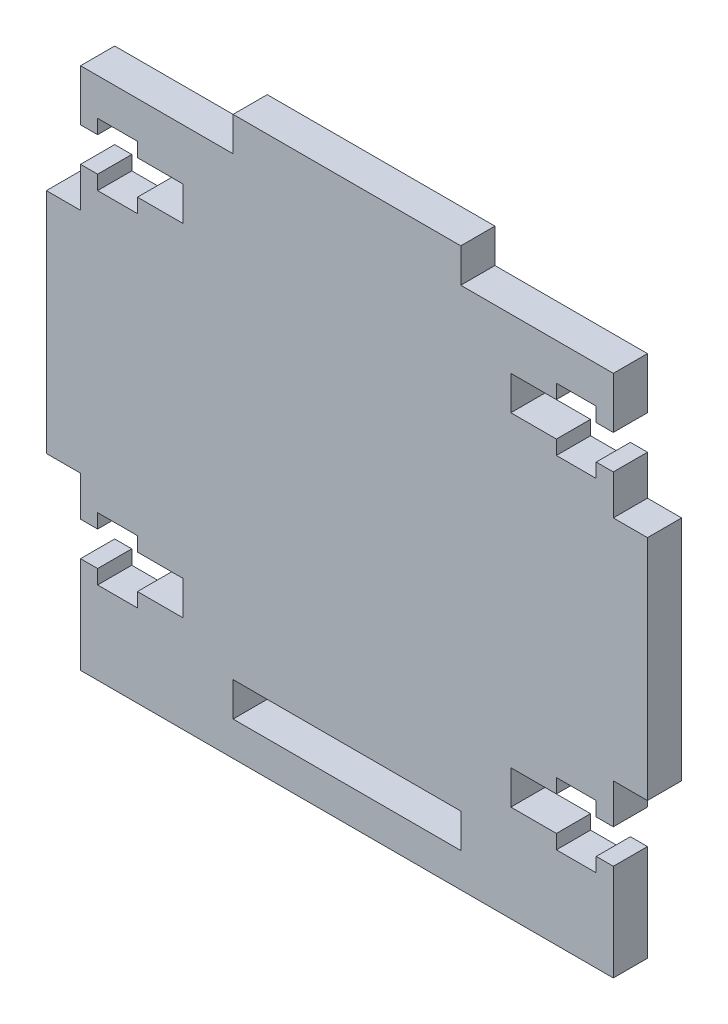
ISO-10303-21;
HEADER;
FILE_DESCRIPTION(('STEP AP214'),'2;1');
FILE_NAME('part.step','',(''),(''),'','','');
FILE_SCHEMA(('AUTOMOTIVE_DESIGN { 1 0 10303 214 1 1 1 1 }'));
ENDSEC;
DATA;
#1=APPLICATION_CONTEXT('core data for automotive mechanical design processes');
#2=APPLICATION_PROTOCOL_DEFINITION('international standard','automotive_design',2000,#1);
#3=PRODUCT_CONTEXT('',#1,'mechanical');
#4=PRODUCT('Part','Part','',(#3));
#5=PRODUCT_RELATED_PRODUCT_CATEGORY('part','',(#4));
#6=PRODUCT_DEFINITION_FORMATION('','',#4);
#7=PRODUCT_DEFINITION_CONTEXT('part definition',#1,'design');
#8=PRODUCT_DEFINITION('design','',#6,#7);
#9=PRODUCT_DEFINITION_SHAPE('','',#8);
#10=(LENGTH_UNIT() NAMED_UNIT(*) SI_UNIT(.MILLI.,.METRE.));
#11=(NAMED_UNIT(*) PLANE_ANGLE_UNIT() SI_UNIT($,.RADIAN.));
#12=(NAMED_UNIT(*) SI_UNIT($,.STERADIAN.) SOLID_ANGLE_UNIT());
#13=UNCERTAINTY_MEASURE_WITH_UNIT(LENGTH_MEASURE(1.E-05),#10,'distance_accuracy_value','');
#14=(GEOMETRIC_REPRESENTATION_CONTEXT(3) GLOBAL_UNCERTAINTY_ASSIGNED_CONTEXT((#13)) GLOBAL_UNIT_ASSIGNED_CONTEXT((#10,
#11,#12)) REPRESENTATION_CONTEXT('',''));
#15=CARTESIAN_POINT('',(0.,0.,0.));
#16=DIRECTION('',(0.,0.,1.));
#17=DIRECTION('',(1.,0.,0.));
#18=AXIS2_PLACEMENT_3D('',#15,#16,#17);
#19=CARTESIAN_POINT('',(-3.4540271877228E-13,14.0000000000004,3.));
#20=DIRECTION('',(0.,1.,0.));
#21=DIRECTION('',(-1.,0.,0.));
#22=AXIS2_PLACEMENT_3D('',#19,#20,#21);
#23=PLANE('',#22);
#24=DIRECTION('',(1.,0.,0.));
#25=VECTOR('',#24,1.);
#26=CARTESIAN_POINT('',(-3.4540271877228E-13,14.0000000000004,0.));
#27=LINE('',#26,#25);
#28=CARTESIAN_POINT('',(14.3999999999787,14.0000000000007,0.));
#29=VERTEX_POINT('',#28);
#30=CARTESIAN_POINT('',(18.3999999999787,14.0000000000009,0.));
#31=VERTEX_POINT('',#30);
#32=EDGE_CURVE('E485',#29,#31,#27,.T.);
#33=ORIENTED_EDGE('',*,*,#32,.F.);
#34=DIRECTION('',(0.,0.,-1.));
#35=VECTOR('',#34,1.);
#36=CARTESIAN_POINT('',(14.3999999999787,14.0000000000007,3.));
#37=LINE('',#36,#35);
#38=CARTESIAN_POINT('',(14.3999999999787,14.0000000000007,3.));
#39=VERTEX_POINT('',#38);
#40=EDGE_CURVE('E886',#39,#29,#37,.T.);
#41=ORIENTED_EDGE('',*,*,#40,.F.);
#42=DIRECTION('',(1.,0.,0.));
#43=VECTOR('',#42,1.);
#44=CARTESIAN_POINT('',(-3.4540271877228E-13,14.0000000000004,3.));
#45=LINE('',#44,#43);
#46=CARTESIAN_POINT('',(18.3999999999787,14.0000000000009,3.));
#47=VERTEX_POINT('',#46);
#48=EDGE_CURVE('E488',#39,#47,#45,.T.);
#49=ORIENTED_EDGE('',*,*,#48,.T.);
#50=DIRECTION('',(0.,0.,-1.));
#51=VECTOR('',#50,1.);
#52=CARTESIAN_POINT('',(18.3999999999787,14.0000000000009,3.));
#53=LINE('',#52,#51);
#54=EDGE_CURVE('E739',#47,#31,#53,.T.);
#55=ORIENTED_EDGE('',*,*,#54,.T.);
#56=EDGE_LOOP('',(#33,#41,#49,#55));
#57=FACE_BOUND('',#56,.T.);
#58=ADVANCED_FACE('F34',(#57),#23,.T.);
#59=CARTESIAN_POINT('',(14.3999999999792,5.32907051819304E-13,3.));
#60=DIRECTION('',(-1.,0.,0.));
#61=DIRECTION('',(0.,-1.,0.));
#62=AXIS2_PLACEMENT_3D('',#59,#60,#61);
#63=PLANE('',#62);
#64=DIRECTION('',(0.,1.,0.));
#65=VECTOR('',#64,1.);
#66=CARTESIAN_POINT('',(14.3999999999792,5.32907051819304E-13,0.));
#67=LINE('',#66,#65);
#68=CARTESIAN_POINT('',(14.3999999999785,17.0000000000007,0.));
#69=VERTEX_POINT('',#68);
#70=EDGE_CURVE('E612',#29,#69,#67,.T.);
#71=ORIENTED_EDGE('',*,*,#70,.T.);
#72=DIRECTION('',(0.,0.,-1.));
#73=VECTOR('',#72,1.);
#74=CARTESIAN_POINT('',(14.3999999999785,17.0000000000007,3.));
#75=LINE('',#74,#73);
#76=CARTESIAN_POINT('',(14.3999999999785,17.0000000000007,3.));
#77=VERTEX_POINT('',#76);
#78=EDGE_CURVE('E883',#77,#69,#75,.T.);
#79=ORIENTED_EDGE('',*,*,#78,.F.);
#80=DIRECTION('',(0.,1.,0.));
#81=VECTOR('',#80,1.);
#82=CARTESIAN_POINT('',(14.3999999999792,5.32907051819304E-13,3.));
#83=LINE('',#82,#81);
#84=EDGE_CURVE('E491',#39,#77,#83,.T.);
#85=ORIENTED_EDGE('',*,*,#84,.F.);
#86=ORIENTED_EDGE('',*,*,#40,.T.);
#87=EDGE_LOOP('',(#71,#79,#85,#86));
#88=FACE_BOUND('',#87,.T.);
#89=ADVANCED_FACE('F36',(#88),#63,.F.);
#90=CARTESIAN_POINT('',(-4.19417587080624E-13,17.0000000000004,3.));
#91=DIRECTION('',(0.,1.,0.));
#92=DIRECTION('',(-1.,0.,0.));
#93=AXIS2_PLACEMENT_3D('',#90,#91,#92);
#94=PLANE('',#93);
#95=DIRECTION('',(1.,0.,0.));
#96=VECTOR('',#95,1.);
#97=CARTESIAN_POINT('',(-4.19417587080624E-13,17.0000000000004,0.));
#98=LINE('',#97,#96);
#99=CARTESIAN_POINT('',(18.3999999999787,17.0000000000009,0.));
#100=VERTEX_POINT('',#99);
#101=EDGE_CURVE('E615',#69,#100,#98,.T.);
#102=ORIENTED_EDGE('',*,*,#101,.T.);
#103=DIRECTION('',(0.,0.,-1.));
#104=VECTOR('',#103,1.);
#105=CARTESIAN_POINT('',(18.3999999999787,17.0000000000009,3.));
#106=LINE('',#105,#104);
#107=CARTESIAN_POINT('',(18.3999999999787,17.0000000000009,3.));
#108=VERTEX_POINT('',#107);
#109=EDGE_CURVE('E880',#108,#100,#106,.T.);
#110=ORIENTED_EDGE('',*,*,#109,.F.);
#111=DIRECTION('',(1.,0.,0.));
#112=VECTOR('',#111,1.);
#113=CARTESIAN_POINT('',(-4.19417587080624E-13,17.0000000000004,3.));
#114=LINE('',#113,#112);
#115=EDGE_CURVE('E495',#77,#108,#114,.T.);
#116=ORIENTED_EDGE('',*,*,#115,.F.);
#117=ORIENTED_EDGE('',*,*,#78,.T.);
#118=EDGE_LOOP('',(#102,#110,#116,#117));
#119=FACE_BOUND('',#118,.T.);
#120=ADVANCED_FACE('F915',(#119),#94,.F.);
#121=CARTESIAN_POINT('',(18.399999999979,3.71420066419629E-13,3.));
#122=DIRECTION('',(-1.,0.,0.));
#123=DIRECTION('',(0.,-1.,0.));
#124=AXIS2_PLACEMENT_3D('',#121,#122,#123);
#125=PLANE('',#124);
#126=DIRECTION('',(0.,1.,0.));
#127=VECTOR('',#126,1.);
#128=CARTESIAN_POINT('',(18.399999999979,3.71420066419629E-13,0.));
#129=LINE('',#128,#127);
#130=CARTESIAN_POINT('',(18.3999999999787,18.250000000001,0.));
#131=VERTEX_POINT('',#130);
#132=EDGE_CURVE('E617',#100,#131,#129,.T.);
#133=ORIENTED_EDGE('',*,*,#132,.T.);
#134=DIRECTION('',(0.,0.,-1.));
#135=VECTOR('',#134,1.);
#136=CARTESIAN_POINT('',(18.3999999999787,18.250000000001,3.));
#137=LINE('',#136,#135);
#138=CARTESIAN_POINT('',(18.3999999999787,18.250000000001,3.));
#139=VERTEX_POINT('',#138);
#140=EDGE_CURVE('E878',#139,#131,#137,.T.);
#141=ORIENTED_EDGE('',*,*,#140,.F.);
#142=DIRECTION('',(0.,1.,0.));
#143=VECTOR('',#142,1.);
#144=CARTESIAN_POINT('',(18.399999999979,3.71420066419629E-13,3.));
#145=LINE('',#144,#143);
#146=EDGE_CURVE('E497',#108,#139,#145,.T.);
#147=ORIENTED_EDGE('',*,*,#146,.F.);
#148=ORIENTED_EDGE('',*,*,#109,.T.);
#149=EDGE_LOOP('',(#133,#141,#147,#148));
#150=FACE_BOUND('',#149,.T.);
#151=ADVANCED_FACE('F1499',(#150),#125,.F.);
#152=CARTESIAN_POINT('',(0.,18.250000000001,3.));
#153=DIRECTION('',(0.,-1.,0.));
#154=DIRECTION('',(0.,0.,-1.));
#155=AXIS2_PLACEMENT_3D('',#152,#153,#154);
#156=PLANE('',#155);
#157=DIRECTION('',(-1.,0.,0.));
#158=VECTOR('',#157,1.);
#159=CARTESIAN_POINT('',(0.,18.250000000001,0.));
#160=LINE('',#159,#158);
#161=CARTESIAN_POINT('',(21.8999999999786,18.250000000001,0.));
#162=VERTEX_POINT('',#161);
#163=EDGE_CURVE('E621',#162,#131,#160,.T.);
#164=ORIENTED_EDGE('',*,*,#163,.F.);
#165=DIRECTION('',(0.,0.,-1.));
#166=VECTOR('',#165,1.);
#167=CARTESIAN_POINT('',(21.8999999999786,18.250000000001,3.));
#168=LINE('',#167,#166);
#169=CARTESIAN_POINT('',(21.8999999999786,18.250000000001,3.));
#170=VERTEX_POINT('',#169);
#171=EDGE_CURVE('E876',#170,#162,#168,.T.);
#172=ORIENTED_EDGE('',*,*,#171,.F.);
#173=DIRECTION('',(-1.,0.,0.));
#174=VECTOR('',#173,1.);
#175=CARTESIAN_POINT('',(0.,18.250000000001,3.));
#176=LINE('',#175,#174);
#177=EDGE_CURVE('E500',#170,#139,#176,.T.);
#178=ORIENTED_EDGE('',*,*,#177,.T.);
#179=ORIENTED_EDGE('',*,*,#140,.T.);
#180=EDGE_LOOP('',(#164,#172,#178,#179));
#181=FACE_BOUND('',#180,.T.);
#182=ADVANCED_FACE('F1490',(#181),#156,.T.);
#183=CARTESIAN_POINT('',(21.899999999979,4.42070622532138E-13,3.));
#184=DIRECTION('',(-1.,0.,0.));
#185=DIRECTION('',(0.,-1.,0.));
#186=AXIS2_PLACEMENT_3D('',#183,#184,#185);
#187=PLANE('',#186);
#188=DIRECTION('',(0.,1.,0.));
#189=VECTOR('',#188,1.);
#190=CARTESIAN_POINT('',(21.899999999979,4.42070622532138E-13,0.));
#191=LINE('',#190,#189);
#192=CARTESIAN_POINT('',(21.8999999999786,17.0000000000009,0.));
#193=VERTEX_POINT('',#192);
#194=EDGE_CURVE('E624',#193,#162,#191,.T.);
#195=ORIENTED_EDGE('',*,*,#194,.F.);
#196=DIRECTION('',(0.,0.,-1.));
#197=VECTOR('',#196,1.);
#198=CARTESIAN_POINT('',(21.8999999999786,17.0000000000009,3.));
#199=LINE('',#198,#197);
#200=CARTESIAN_POINT('',(21.8999999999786,17.0000000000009,3.));
#201=VERTEX_POINT('',#200);
#202=EDGE_CURVE('E874',#201,#193,#199,.T.);
#203=ORIENTED_EDGE('',*,*,#202,.F.);
#204=DIRECTION('',(0.,1.,0.));
#205=VECTOR('',#204,1.);
#206=CARTESIAN_POINT('',(21.899999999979,4.42070622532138E-13,3.));
#207=LINE('',#206,#205);
#208=EDGE_CURVE('E504',#201,#170,#207,.T.);
#209=ORIENTED_EDGE('',*,*,#208,.T.);
#210=ORIENTED_EDGE('',*,*,#171,.T.);
#211=EDGE_LOOP('',(#195,#203,#209,#210));
#212=FACE_BOUND('',#211,.T.);
#213=ADVANCED_FACE('F930',(#212),#187,.T.);
#214=CARTESIAN_POINT('',(23.4000000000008,17.000000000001,0.));
#215=VERTEX_POINT('',#214);
#216=EDGE_CURVE('E618',#193,#215,#98,.T.);
#217=ORIENTED_EDGE('',*,*,#216,.T.);
#218=DIRECTION('',(0.,0.,-1.));
#219=VECTOR('',#218,1.);
#220=CARTESIAN_POINT('',(23.4000000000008,17.000000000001,3.));
#221=LINE('',#220,#219);
#222=CARTESIAN_POINT('',(23.4000000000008,17.000000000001,3.));
#223=VERTEX_POINT('',#222);
#224=EDGE_CURVE('E872',#223,#215,#221,.T.);
#225=ORIENTED_EDGE('',*,*,#224,.F.);
#226=EDGE_CURVE('E498',#201,#223,#114,.T.);
#227=ORIENTED_EDGE('',*,*,#226,.F.);
#228=ORIENTED_EDGE('',*,*,#202,.T.);
#229=EDGE_LOOP('',(#217,#225,#227,#228));
#230=FACE_BOUND('',#229,.T.);
#231=ADVANCED_FACE('F1472',(#230),#94,.F.);
#232=CARTESIAN_POINT('',(23.4000000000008,0.,3.));
#233=DIRECTION('',(1.,0.,0.));
#234=DIRECTION('',(0.,0.,-1.));
#235=AXIS2_PLACEMENT_3D('',#232,#233,#234);
#236=PLANE('',#235);
#237=DIRECTION('',(0.,-1.,0.));
#238=VECTOR('',#237,1.);
#239=CARTESIAN_POINT('',(23.4000000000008,0.,0.));
#240=LINE('',#239,#238);
#241=CARTESIAN_POINT('',(23.4000000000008,21.5000000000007,0.));
#242=VERTEX_POINT('',#241);
#243=EDGE_CURVE('E628',#242,#215,#240,.T.);
#244=ORIENTED_EDGE('',*,*,#243,.F.);
#245=DIRECTION('',(0.,0.,-1.));
#246=VECTOR('',#245,1.);
#247=CARTESIAN_POINT('',(23.4000000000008,21.5000000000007,3.));
#248=LINE('',#247,#246);
#249=CARTESIAN_POINT('',(23.4000000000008,21.5000000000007,3.));
#250=VERTEX_POINT('',#249);
#251=EDGE_CURVE('E870',#250,#242,#248,.T.);
#252=ORIENTED_EDGE('',*,*,#251,.F.);
#253=DIRECTION('',(0.,-1.,0.));
#254=VECTOR('',#253,1.);
#255=CARTESIAN_POINT('',(23.4000000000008,0.,3.));
#256=LINE('',#255,#254);
#257=EDGE_CURVE('E508',#250,#223,#256,.T.);
#258=ORIENTED_EDGE('',*,*,#257,.T.);
#259=ORIENTED_EDGE('',*,*,#224,.T.);
#260=EDGE_LOOP('',(#244,#252,#258,#259));
#261=FACE_BOUND('',#260,.T.);
#262=ADVANCED_FACE('F933',(#261),#236,.T.);
#263=CARTESIAN_POINT('',(0.,21.5000000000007,3.));
#264=DIRECTION('',(0.,1.,0.));
#265=DIRECTION('',(0.,0.,1.));
#266=AXIS2_PLACEMENT_3D('',#263,#264,#265);
#267=PLANE('',#266);
#268=DIRECTION('',(1.,0.,0.));
#269=VECTOR('',#268,1.);
#270=CARTESIAN_POINT('',(0.,21.5000000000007,0.));
#271=LINE('',#270,#269);
#272=CARTESIAN_POINT('',(9.99999999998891,21.5,0.));
#273=VERTEX_POINT('',#272);
#274=EDGE_CURVE('E631',#273,#242,#271,.T.);
#275=ORIENTED_EDGE('',*,*,#274,.F.);
#276=DIRECTION('',(0.,0.,-1.));
#277=VECTOR('',#276,1.);
#278=CARTESIAN_POINT('',(9.99999999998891,21.5,3.));
#279=LINE('',#278,#277);
#280=CARTESIAN_POINT('',(9.99999999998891,21.5,3.));
#281=VERTEX_POINT('',#280);
#282=EDGE_CURVE('E868',#281,#273,#279,.T.);
#283=ORIENTED_EDGE('',*,*,#282,.F.);
#284=DIRECTION('',(1.,0.,0.));
#285=VECTOR('',#284,1.);
#286=CARTESIAN_POINT('',(0.,21.5000000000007,3.));
#287=LINE('',#286,#285);
#288=EDGE_CURVE('E511',#281,#250,#287,.T.);
#289=ORIENTED_EDGE('',*,*,#288,.T.);
#290=ORIENTED_EDGE('',*,*,#251,.T.);
#291=EDGE_LOOP('',(#275,#283,#289,#290));
#292=FACE_BOUND('',#291,.T.);
#293=ADVANCED_FACE('F1425',(#292),#267,.T.);
#294=CARTESIAN_POINT('',(9.99999999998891,0.,3.));
#295=DIRECTION('',(-1.,0.,0.));
#296=DIRECTION('',(0.,0.,1.));
#297=AXIS2_PLACEMENT_3D('',#294,#295,#296);
#298=PLANE('',#297);
#299=DIRECTION('',(0.,1.,0.));
#300=VECTOR('',#299,1.);
#301=CARTESIAN_POINT('',(9.99999999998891,0.,0.));
#302=LINE('',#301,#300);
#303=CARTESIAN_POINT('',(9.99999999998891,24.4999999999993,0.));
#304=VERTEX_POINT('',#303);
#305=EDGE_CURVE('E636',#273,#304,#302,.T.);
#306=ORIENTED_EDGE('',*,*,#305,.T.);
#307=DIRECTION('',(0.,0.,-1.));
#308=VECTOR('',#307,1.);
#309=CARTESIAN_POINT('',(9.99999999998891,24.4999999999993,3.));
#310=LINE('',#309,#308);
#311=CARTESIAN_POINT('',(9.99999999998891,24.4999999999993,3.));
#312=VERTEX_POINT('',#311);
#313=EDGE_CURVE('E865',#312,#304,#310,.T.);
#314=ORIENTED_EDGE('',*,*,#313,.F.);
#315=DIRECTION('',(0.,1.,0.));
#316=VECTOR('',#315,1.);
#317=CARTESIAN_POINT('',(9.99999999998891,0.,3.));
#318=LINE('',#317,#316);
#319=EDGE_CURVE('E516',#281,#312,#318,.T.);
#320=ORIENTED_EDGE('',*,*,#319,.F.);
#321=ORIENTED_EDGE('',*,*,#282,.T.);
#322=EDGE_LOOP('',(#306,#314,#320,#321));
#323=FACE_BOUND('',#322,.T.);
#324=ADVANCED_FACE('F1444',(#323),#298,.F.);
#325=CARTESIAN_POINT('',(-1.36002320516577E-13,24.4999999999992,3.));
#326=DIRECTION('',(0.,-1.,0.));
#327=DIRECTION('',(1.,0.,0.));
#328=AXIS2_PLACEMENT_3D('',#325,#326,#327);
#329=PLANE('',#328);
#330=DIRECTION('',(-1.,0.,0.));
#331=VECTOR('',#330,1.);
#332=CARTESIAN_POINT('',(-1.36002320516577E-13,24.4999999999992,0.));
#333=LINE('',#332,#331);
#334=CARTESIAN_POINT('',(-10.0000000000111,24.4999999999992,0.));
#335=VERTEX_POINT('',#334);
#336=EDGE_CURVE('E639',#304,#335,#333,.T.);
#337=ORIENTED_EDGE('',*,*,#336,.T.);
#338=DIRECTION('',(0.,0.,-1.));
#339=VECTOR('',#338,1.);
#340=CARTESIAN_POINT('',(-10.0000000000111,24.4999999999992,3.));
#341=LINE('',#340,#339);
#342=CARTESIAN_POINT('',(-10.0000000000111,24.4999999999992,3.));
#343=VERTEX_POINT('',#342);
#344=EDGE_CURVE('E862',#343,#335,#341,.T.);
#345=ORIENTED_EDGE('',*,*,#344,.F.);
#346=DIRECTION('',(-1.,0.,0.));
#347=VECTOR('',#346,1.);
#348=CARTESIAN_POINT('',(-1.36002320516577E-13,24.4999999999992,3.));
#349=LINE('',#348,#347);
#350=EDGE_CURVE('E519',#312,#343,#349,.T.);
#351=ORIENTED_EDGE('',*,*,#350,.F.);
#352=ORIENTED_EDGE('',*,*,#313,.T.);
#353=EDGE_LOOP('',(#337,#345,#351,#352));
#354=FACE_BOUND('',#353,.T.);
#355=ADVANCED_FACE('F1434',(#354),#329,.F.);
#356=CARTESIAN_POINT('',(-10.0000000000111,0.,3.));
#357=DIRECTION('',(1.,0.,0.));
#358=DIRECTION('',(0.,0.,-1.));
#359=AXIS2_PLACEMENT_3D('',#356,#357,#358);
#360=PLANE('',#359);
#361=DIRECTION('',(0.,-1.,0.));
#362=VECTOR('',#361,1.);
#363=CARTESIAN_POINT('',(-10.0000000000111,0.,0.));
#364=LINE('',#363,#362);
#365=CARTESIAN_POINT('',(-10.0000000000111,21.4999999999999,0.));
#366=VERTEX_POINT('',#365);
#367=EDGE_CURVE('E641',#335,#366,#364,.T.);
#368=ORIENTED_EDGE('',*,*,#367,.T.);
#369=DIRECTION('',(0.,0.,-1.));
#370=VECTOR('',#369,1.);
#371=CARTESIAN_POINT('',(-10.0000000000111,21.4999999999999,3.));
#372=LINE('',#371,#370);
#373=CARTESIAN_POINT('',(-10.0000000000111,21.4999999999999,3.));
#374=VERTEX_POINT('',#373);
#375=EDGE_CURVE('E860',#374,#366,#372,.T.);
#376=ORIENTED_EDGE('',*,*,#375,.F.);
#377=DIRECTION('',(0.,-1.,0.));
#378=VECTOR('',#377,1.);
#379=CARTESIAN_POINT('',(-10.0000000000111,0.,3.));
#380=LINE('',#379,#378);
#381=EDGE_CURVE('E521',#343,#374,#380,.T.);
#382=ORIENTED_EDGE('',*,*,#381,.F.);
#383=ORIENTED_EDGE('',*,*,#344,.T.);
#384=EDGE_LOOP('',(#368,#376,#382,#383));
#385=FACE_BOUND('',#384,.T.);
#386=ADVANCED_FACE('F1422',(#385),#360,.F.);
#387=CARTESIAN_POINT('',(-23.4000000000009,21.5000000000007,0.));
#388=VERTEX_POINT('',#387);
#389=EDGE_CURVE('E637',#388,#366,#271,.T.);
#390=ORIENTED_EDGE('',*,*,#389,.F.);
#391=DIRECTION('',(0.,0.,-1.));
#392=VECTOR('',#391,1.);
#393=CARTESIAN_POINT('',(-23.4000000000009,21.5000000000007,3.));
#394=LINE('',#393,#392);
#395=CARTESIAN_POINT('',(-23.4000000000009,21.5000000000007,3.));
#396=VERTEX_POINT('',#395);
#397=EDGE_CURVE('E858',#396,#388,#394,.T.);
#398=ORIENTED_EDGE('',*,*,#397,.F.);
#399=EDGE_CURVE('E517',#396,#374,#287,.T.);
#400=ORIENTED_EDGE('',*,*,#399,.T.);
#401=ORIENTED_EDGE('',*,*,#375,.T.);
#402=EDGE_LOOP('',(#390,#398,#400,#401));
#403=FACE_BOUND('',#402,.T.);
#404=ADVANCED_FACE('F1413',(#403),#267,.T.);
#405=CARTESIAN_POINT('',(-23.4000000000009,0.,3.));
#406=DIRECTION('',(1.,0.,0.));
#407=DIRECTION('',(0.,0.,-1.));
#408=AXIS2_PLACEMENT_3D('',#405,#406,#407);
#409=PLANE('',#408);
#410=DIRECTION('',(0.,-1.,0.));
#411=VECTOR('',#410,1.);
#412=CARTESIAN_POINT('',(-23.4000000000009,0.,0.));
#413=LINE('',#412,#411);
#414=CARTESIAN_POINT('',(-23.4000000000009,17.0000000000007,0.));
#415=VERTEX_POINT('',#414);
#416=EDGE_CURVE('E644',#388,#415,#413,.T.);
#417=ORIENTED_EDGE('',*,*,#416,.T.);
#418=DIRECTION('',(0.,0.,-1.));
#419=VECTOR('',#418,1.);
#420=CARTESIAN_POINT('',(-23.4000000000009,17.0000000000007,3.));
#421=LINE('',#420,#419);
#422=CARTESIAN_POINT('',(-23.4000000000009,17.0000000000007,3.));
#423=VERTEX_POINT('',#422);
#424=EDGE_CURVE('E856',#423,#415,#421,.T.);
#425=ORIENTED_EDGE('',*,*,#424,.F.);
#426=DIRECTION('',(0.,-1.,0.));
#427=VECTOR('',#426,1.);
#428=CARTESIAN_POINT('',(-23.4000000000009,0.,3.));
#429=LINE('',#428,#427);
#430=EDGE_CURVE('E523',#396,#423,#429,.T.);
#431=ORIENTED_EDGE('',*,*,#430,.F.);
#432=ORIENTED_EDGE('',*,*,#397,.T.);
#433=EDGE_LOOP('',(#417,#425,#431,#432));
#434=FACE_BOUND('',#433,.T.);
#435=ADVANCED_FACE('F1144',(#434),#409,.F.);
#436=CARTESIAN_POINT('',(0.,17.0000000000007,3.));
#437=DIRECTION('',(0.,-1.,0.));
#438=DIRECTION('',(0.,0.,-1.));
#439=AXIS2_PLACEMENT_3D('',#436,#437,#438);
#440=PLANE('',#439);
#441=DIRECTION('',(-1.,0.,0.));
#442=VECTOR('',#441,1.);
#443=CARTESIAN_POINT('',(0.,17.0000000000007,0.));
#444=LINE('',#443,#442);
#445=CARTESIAN_POINT('',(-21.9000000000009,17.0000000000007,0.));
#446=VERTEX_POINT('',#445);
#447=EDGE_CURVE('E647',#446,#415,#444,.T.);
#448=ORIENTED_EDGE('',*,*,#447,.F.);
#449=DIRECTION('',(0.,0.,-1.));
#450=VECTOR('',#449,1.);
#451=CARTESIAN_POINT('',(-21.9000000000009,17.0000000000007,3.));
#452=LINE('',#451,#450);
#453=CARTESIAN_POINT('',(-21.9000000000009,17.0000000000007,3.));
#454=VERTEX_POINT('',#453);
#455=EDGE_CURVE('E854',#454,#446,#452,.T.);
#456=ORIENTED_EDGE('',*,*,#455,.F.);
#457=DIRECTION('',(-1.,0.,0.));
#458=VECTOR('',#457,1.);
#459=CARTESIAN_POINT('',(0.,17.0000000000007,3.));
#460=LINE('',#459,#458);
#461=EDGE_CURVE('E525',#454,#423,#460,.T.);
#462=ORIENTED_EDGE('',*,*,#461,.T.);
#463=ORIENTED_EDGE('',*,*,#424,.T.);
#464=EDGE_LOOP('',(#448,#456,#462,#463));
#465=FACE_BOUND('',#464,.T.);
#466=ADVANCED_FACE('F1371',(#465),#440,.T.);
#467=CARTESIAN_POINT('',(-21.9000000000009,0.,3.));
#468=DIRECTION('',(-1.,0.,0.));
#469=DIRECTION('',(0.,0.,1.));
#470=AXIS2_PLACEMENT_3D('',#467,#468,#469);
#471=PLANE('',#470);
#472=DIRECTION('',(0.,1.,0.));
#473=VECTOR('',#472,1.);
#474=CARTESIAN_POINT('',(-21.9000000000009,0.,0.));
#475=LINE('',#474,#473);
#476=CARTESIAN_POINT('',(-21.9000000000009,18.2500000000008,0.));
#477=VERTEX_POINT('',#476);
#478=EDGE_CURVE('E652',#446,#477,#475,.T.);
#479=ORIENTED_EDGE('',*,*,#478,.T.);
#480=DIRECTION('',(0.,0.,-1.));
#481=VECTOR('',#480,1.);
#482=CARTESIAN_POINT('',(-21.9000000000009,18.2500000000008,3.));
#483=LINE('',#482,#481);
#484=CARTESIAN_POINT('',(-21.9000000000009,18.2500000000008,3.));
#485=VERTEX_POINT('',#484);
#486=EDGE_CURVE('E851',#485,#477,#483,.T.);
#487=ORIENTED_EDGE('',*,*,#486,.F.);
#488=DIRECTION('',(0.,1.,0.));
#489=VECTOR('',#488,1.);
#490=CARTESIAN_POINT('',(-21.9000000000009,0.,3.));
#491=LINE('',#490,#489);
#492=EDGE_CURVE('E530',#454,#485,#491,.T.);
#493=ORIENTED_EDGE('',*,*,#492,.F.);
#494=ORIENTED_EDGE('',*,*,#455,.T.);
#495=EDGE_LOOP('',(#479,#487,#493,#494));
#496=FACE_BOUND('',#495,.T.);
#497=ADVANCED_FACE('F1322',(#496),#471,.F.);
#498=CARTESIAN_POINT('',(0.,18.2500000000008,3.));
#499=DIRECTION('',(0.,1.,0.));
#500=DIRECTION('',(0.,0.,1.));
#501=AXIS2_PLACEMENT_3D('',#498,#499,#500);
#502=PLANE('',#501);
#503=DIRECTION('',(1.,0.,0.));
#504=VECTOR('',#503,1.);
#505=CARTESIAN_POINT('',(0.,18.2500000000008,0.));
#506=LINE('',#505,#504);
#507=CARTESIAN_POINT('',(-18.400000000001,18.2500000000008,0.));
#508=VERTEX_POINT('',#507);
#509=EDGE_CURVE('E655',#477,#508,#506,.T.);
#510=ORIENTED_EDGE('',*,*,#509,.T.);
#511=DIRECTION('',(0.,0.,-1.));
#512=VECTOR('',#511,1.);
#513=CARTESIAN_POINT('',(-18.400000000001,18.2500000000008,3.));
#514=LINE('',#513,#512);
#515=CARTESIAN_POINT('',(-18.400000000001,18.2500000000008,3.));
#516=VERTEX_POINT('',#515);
#517=EDGE_CURVE('E849',#516,#508,#514,.T.);
#518=ORIENTED_EDGE('',*,*,#517,.F.);
#519=DIRECTION('',(1.,0.,0.));
#520=VECTOR('',#519,1.);
#521=CARTESIAN_POINT('',(0.,18.2500000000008,3.));
#522=LINE('',#521,#520);
#523=EDGE_CURVE('E533',#485,#516,#522,.T.);
#524=ORIENTED_EDGE('',*,*,#523,.F.);
#525=ORIENTED_EDGE('',*,*,#486,.T.);
#526=EDGE_LOOP('',(#510,#518,#524,#525));
#527=FACE_BOUND('',#526,.T.);
#528=ADVANCED_FACE('F1379',(#527),#502,.F.);
#529=CARTESIAN_POINT('',(-18.400000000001,0.,3.));
#530=DIRECTION('',(-1.,0.,0.));
#531=DIRECTION('',(0.,0.,1.));
#532=AXIS2_PLACEMENT_3D('',#529,#530,#531);
#533=PLANE('',#532);
#534=DIRECTION('',(0.,1.,0.));
#535=VECTOR('',#534,1.);
#536=CARTESIAN_POINT('',(-18.400000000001,0.,0.));
#537=LINE('',#536,#535);
#538=CARTESIAN_POINT('',(-18.400000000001,17.0000000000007,0.));
#539=VERTEX_POINT('',#538);
#540=EDGE_CURVE('E659',#539,#508,#537,.T.);
#541=ORIENTED_EDGE('',*,*,#540,.F.);
#542=DIRECTION('',(0.,0.,-1.));
#543=VECTOR('',#542,1.);
#544=CARTESIAN_POINT('',(-18.400000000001,17.0000000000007,3.));
#545=LINE('',#544,#543);
#546=CARTESIAN_POINT('',(-18.400000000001,17.0000000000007,3.));
#547=VERTEX_POINT('',#546);
#548=EDGE_CURVE('E847',#547,#539,#545,.T.);
#549=ORIENTED_EDGE('',*,*,#548,.F.);
#550=DIRECTION('',(0.,1.,0.));
#551=VECTOR('',#550,1.);
#552=CARTESIAN_POINT('',(-18.400000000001,0.,3.));
#553=LINE('',#552,#551);
#554=EDGE_CURVE('E536',#547,#516,#553,.T.);
#555=ORIENTED_EDGE('',*,*,#554,.T.);
#556=ORIENTED_EDGE('',*,*,#517,.T.);
#557=EDGE_LOOP('',(#541,#549,#555,#556));
#558=FACE_BOUND('',#557,.T.);
#559=ADVANCED_FACE('F1342',(#558),#533,.T.);
#560=CARTESIAN_POINT('',(-14.4000000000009,17.0000000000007,0.));
#561=VERTEX_POINT('',#560);
#562=EDGE_CURVE('E653',#561,#539,#444,.T.);
#563=ORIENTED_EDGE('',*,*,#562,.F.);
#564=DIRECTION('',(0.,0.,-1.));
#565=VECTOR('',#564,1.);
#566=CARTESIAN_POINT('',(-14.4000000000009,17.0000000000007,3.));
#567=LINE('',#566,#565);
#568=CARTESIAN_POINT('',(-14.4000000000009,17.0000000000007,3.));
#569=VERTEX_POINT('',#568);
#570=EDGE_CURVE('E845',#569,#561,#567,.T.);
#571=ORIENTED_EDGE('',*,*,#570,.F.);
#572=EDGE_CURVE('E531',#569,#547,#460,.T.);
#573=ORIENTED_EDGE('',*,*,#572,.T.);
#574=ORIENTED_EDGE('',*,*,#548,.T.);
#575=EDGE_LOOP('',(#563,#571,#573,#574));
#576=FACE_BOUND('',#575,.T.);
#577=ADVANCED_FACE('F1359',(#576),#440,.T.);
#578=CARTESIAN_POINT('',(-14.4000000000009,0.,3.));
#579=DIRECTION('',(-1.,0.,0.));
#580=DIRECTION('',(0.,0.,1.));
#581=AXIS2_PLACEMENT_3D('',#578,#579,#580);
#582=PLANE('',#581);
#583=DIRECTION('',(0.,1.,0.));
#584=VECTOR('',#583,1.);
#585=CARTESIAN_POINT('',(-14.4000000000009,0.,0.));
#586=LINE('',#585,#584);
#587=CARTESIAN_POINT('',(-14.4000000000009,14.0000000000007,0.));
#588=VERTEX_POINT('',#587);
#589=EDGE_CURVE('E663',#588,#561,#586,.T.);
#590=ORIENTED_EDGE('',*,*,#589,.F.);
#591=DIRECTION('',(0.,0.,-1.));
#592=VECTOR('',#591,1.);
#593=CARTESIAN_POINT('',(-14.4000000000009,14.0000000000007,3.));
#594=LINE('',#593,#592);
#595=CARTESIAN_POINT('',(-14.4000000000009,14.0000000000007,3.));
#596=VERTEX_POINT('',#595);
#597=EDGE_CURVE('E843',#596,#588,#594,.T.);
#598=ORIENTED_EDGE('',*,*,#597,.F.);
#599=DIRECTION('',(0.,1.,0.));
#600=VECTOR('',#599,1.);
#601=CARTESIAN_POINT('',(-14.4000000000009,0.,3.));
#602=LINE('',#601,#600);
#603=EDGE_CURVE('E540',#596,#569,#602,.T.);
#604=ORIENTED_EDGE('',*,*,#603,.T.);
#605=ORIENTED_EDGE('',*,*,#570,.T.);
#606=EDGE_LOOP('',(#590,#598,#604,#605));
#607=FACE_BOUND('',#606,.T.);
#608=ADVANCED_FACE('F1350',(#607),#582,.T.);
#609=CARTESIAN_POINT('',(0.,14.0000000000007,3.));
#610=DIRECTION('',(0.,-1.,0.));
#611=DIRECTION('',(0.,0.,-1.));
#612=AXIS2_PLACEMENT_3D('',#609,#610,#611);
#613=PLANE('',#612);
#614=DIRECTION('',(-1.,0.,0.));
#615=VECTOR('',#614,1.);
#616=CARTESIAN_POINT('',(0.,14.0000000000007,0.));
#617=LINE('',#616,#615);
#618=CARTESIAN_POINT('',(-18.400000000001,14.0000000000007,0.));
#619=VERTEX_POINT('',#618);
#620=EDGE_CURVE('E666',#588,#619,#617,.T.);
#621=ORIENTED_EDGE('',*,*,#620,.T.);
#622=DIRECTION('',(0.,0.,-1.));
#623=VECTOR('',#622,1.);
#624=CARTESIAN_POINT('',(-18.400000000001,14.0000000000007,3.));
#625=LINE('',#624,#623);
#626=CARTESIAN_POINT('',(-18.400000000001,14.0000000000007,3.));
#627=VERTEX_POINT('',#626);
#628=EDGE_CURVE('E841',#627,#619,#625,.T.);
#629=ORIENTED_EDGE('',*,*,#628,.F.);
#630=DIRECTION('',(-1.,0.,0.));
#631=VECTOR('',#630,1.);
#632=CARTESIAN_POINT('',(0.,14.0000000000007,3.));
#633=LINE('',#632,#631);
#634=EDGE_CURVE('E543',#596,#627,#633,.T.);
#635=ORIENTED_EDGE('',*,*,#634,.F.);
#636=ORIENTED_EDGE('',*,*,#597,.T.);
#637=EDGE_LOOP('',(#621,#629,#635,#636));
#638=FACE_BOUND('',#637,.T.);
#639=ADVANCED_FACE('F1311',(#638),#613,.F.);
#640=CARTESIAN_POINT('',(-18.400000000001,12.7500000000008,0.));
#641=VERTEX_POINT('',#640);
#642=EDGE_CURVE('E662',#641,#619,#537,.T.);
#643=ORIENTED_EDGE('',*,*,#642,.F.);
#644=DIRECTION('',(0.,0.,-1.));
#645=VECTOR('',#644,1.);
#646=CARTESIAN_POINT('',(-18.400000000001,12.7500000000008,3.));
#647=LINE('',#646,#645);
#648=CARTESIAN_POINT('',(-18.400000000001,12.7500000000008,3.));
#649=VERTEX_POINT('',#648);
#650=EDGE_CURVE('E839',#649,#641,#647,.T.);
#651=ORIENTED_EDGE('',*,*,#650,.F.);
#652=EDGE_CURVE('E539',#649,#627,#553,.T.);
#653=ORIENTED_EDGE('',*,*,#652,.T.);
#654=ORIENTED_EDGE('',*,*,#628,.T.);
#655=EDGE_LOOP('',(#643,#651,#653,#654));
#656=FACE_BOUND('',#655,.T.);
#657=ADVANCED_FACE('F1330',(#656),#533,.T.);
#658=CARTESIAN_POINT('',(0.,12.7500000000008,3.));
#659=DIRECTION('',(0.,1.,0.));
#660=DIRECTION('',(0.,0.,1.));
#661=AXIS2_PLACEMENT_3D('',#658,#659,#660);
#662=PLANE('',#661);
#663=DIRECTION('',(1.,0.,0.));
#664=VECTOR('',#663,1.);
#665=CARTESIAN_POINT('',(0.,12.7500000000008,0.));
#666=LINE('',#665,#664);
#667=CARTESIAN_POINT('',(-21.9000000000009,12.7500000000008,0.));
#668=VERTEX_POINT('',#667);
#669=EDGE_CURVE('E670',#668,#641,#666,.T.);
#670=ORIENTED_EDGE('',*,*,#669,.F.);
#671=DIRECTION('',(0.,0.,-1.));
#672=VECTOR('',#671,1.);
#673=CARTESIAN_POINT('',(-21.9000000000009,12.7500000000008,3.));
#674=LINE('',#673,#672);
#675=CARTESIAN_POINT('',(-21.9000000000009,12.7500000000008,3.));
#676=VERTEX_POINT('',#675);
#677=EDGE_CURVE('E837',#676,#668,#674,.T.);
#678=ORIENTED_EDGE('',*,*,#677,.F.);
#679=DIRECTION('',(1.,0.,0.));
#680=VECTOR('',#679,1.);
#681=CARTESIAN_POINT('',(0.,12.7500000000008,3.));
#682=LINE('',#681,#680);
#683=EDGE_CURVE('E546',#676,#649,#682,.T.);
#684=ORIENTED_EDGE('',*,*,#683,.T.);
#685=ORIENTED_EDGE('',*,*,#650,.T.);
#686=EDGE_LOOP('',(#670,#678,#684,#685));
#687=FACE_BOUND('',#686,.T.);
#688=ADVANCED_FACE('F1319',(#687),#662,.T.);
#689=CARTESIAN_POINT('',(-21.9000000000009,14.0000000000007,0.));
#690=VERTEX_POINT('',#689);
#691=EDGE_CURVE('E656',#668,#690,#475,.T.);
#692=ORIENTED_EDGE('',*,*,#691,.T.);
#693=DIRECTION('',(0.,0.,-1.));
#694=VECTOR('',#693,1.);
#695=CARTESIAN_POINT('',(-21.9000000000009,14.0000000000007,3.));
#696=LINE('',#695,#694);
#697=CARTESIAN_POINT('',(-21.9000000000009,14.0000000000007,3.));
#698=VERTEX_POINT('',#697);
#699=EDGE_CURVE('E834',#698,#690,#696,.T.);
#700=ORIENTED_EDGE('',*,*,#699,.F.);
#701=EDGE_CURVE('E534',#676,#698,#491,.T.);
#702=ORIENTED_EDGE('',*,*,#701,.F.);
#703=ORIENTED_EDGE('',*,*,#677,.T.);
#704=EDGE_LOOP('',(#692,#700,#702,#703));
#705=FACE_BOUND('',#704,.T.);
#706=ADVANCED_FACE('F1308',(#705),#471,.F.);
#707=CARTESIAN_POINT('',(-23.4000000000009,14.0000000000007,0.));
#708=VERTEX_POINT('',#707);
#709=EDGE_CURVE('E669',#690,#708,#617,.T.);
#710=ORIENTED_EDGE('',*,*,#709,.T.);
#711=DIRECTION('',(0.,0.,-1.));
#712=VECTOR('',#711,1.);
#713=CARTESIAN_POINT('',(-23.4000000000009,14.0000000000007,3.));
#714=LINE('',#713,#712);
#715=CARTESIAN_POINT('',(-23.4000000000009,14.0000000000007,3.));
#716=VERTEX_POINT('',#715);
#717=EDGE_CURVE('E831',#716,#708,#714,.T.);
#718=ORIENTED_EDGE('',*,*,#717,.F.);
#719=EDGE_CURVE('E545',#698,#716,#633,.T.);
#720=ORIENTED_EDGE('',*,*,#719,.F.);
#721=ORIENTED_EDGE('',*,*,#699,.T.);
#722=EDGE_LOOP('',(#710,#718,#720,#721));
#723=FACE_BOUND('',#722,.T.);
#724=ADVANCED_FACE('F1298',(#723),#613,.F.);
#725=CARTESIAN_POINT('',(-23.4000000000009,10.5000000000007,0.));
#726=VERTEX_POINT('',#725);
#727=EDGE_CURVE('E649',#708,#726,#413,.T.);
#728=ORIENTED_EDGE('',*,*,#727,.T.);
#729=DIRECTION('',(0.,0.,-1.));
#730=VECTOR('',#729,1.);
#731=CARTESIAN_POINT('',(-23.4000000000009,10.5000000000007,3.));
#732=LINE('',#731,#730);
#733=CARTESIAN_POINT('',(-23.4000000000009,10.5000000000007,3.));
#734=VERTEX_POINT('',#733);
#735=EDGE_CURVE('E828',#734,#726,#732,.T.);
#736=ORIENTED_EDGE('',*,*,#735,.F.);
#737=EDGE_CURVE('E527',#716,#734,#429,.T.);
#738=ORIENTED_EDGE('',*,*,#737,.F.);
#739=ORIENTED_EDGE('',*,*,#717,.T.);
#740=EDGE_LOOP('',(#728,#736,#738,#739));
#741=FACE_BOUND('',#740,.T.);
#742=ADVANCED_FACE('F1260',(#741),#409,.F.);
#743=CARTESIAN_POINT('',(0.,10.5000000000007,3.));
#744=DIRECTION('',(0.,-1.,0.));
#745=DIRECTION('',(0.,0.,-1.));
#746=AXIS2_PLACEMENT_3D('',#743,#744,#745);
#747=PLANE('',#746);
#748=DIRECTION('',(-1.,0.,0.));
#749=VECTOR('',#748,1.);
#750=CARTESIAN_POINT('',(0.,10.5000000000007,0.));
#751=LINE('',#750,#749);
#752=CARTESIAN_POINT('',(-26.4000000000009,10.5000000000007,0.));
#753=VERTEX_POINT('',#752);
#754=EDGE_CURVE('E673',#726,#753,#751,.T.);
#755=ORIENTED_EDGE('',*,*,#754,.T.);
#756=DIRECTION('',(0.,0.,-1.));
#757=VECTOR('',#756,1.);
#758=CARTESIAN_POINT('',(-26.4000000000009,10.5000000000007,3.));
#759=LINE('',#758,#757);
#760=CARTESIAN_POINT('',(-26.4000000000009,10.5000000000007,3.));
#761=VERTEX_POINT('',#760);
#762=EDGE_CURVE('E825',#761,#753,#759,.T.);
#763=ORIENTED_EDGE('',*,*,#762,.F.);
#764=DIRECTION('',(-1.,0.,0.));
#765=VECTOR('',#764,1.);
#766=CARTESIAN_POINT('',(0.,10.5000000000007,3.));
#767=LINE('',#766,#765);
#768=EDGE_CURVE('E549',#734,#761,#767,.T.);
#769=ORIENTED_EDGE('',*,*,#768,.F.);
#770=ORIENTED_EDGE('',*,*,#735,.T.);
#771=EDGE_LOOP('',(#755,#763,#769,#770));
#772=FACE_BOUND('',#771,.T.);
#773=ADVANCED_FACE('F1279',(#772),#747,.F.);
#774=CARTESIAN_POINT('',(-26.4000000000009,0.,3.));
#775=DIRECTION('',(1.,0.,0.));
#776=DIRECTION('',(0.,0.,-1.));
#777=AXIS2_PLACEMENT_3D('',#774,#775,#776);
#778=PLANE('',#777);
#779=DIRECTION('',(0.,-1.,0.));
#780=VECTOR('',#779,1.);
#781=CARTESIAN_POINT('',(-26.4000000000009,0.,0.));
#782=LINE('',#781,#780);
#783=CARTESIAN_POINT('',(-26.4000000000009,-9.49999999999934,0.));
#784=VERTEX_POINT('',#783);
#785=EDGE_CURVE('E675',#753,#784,#782,.T.);
#786=ORIENTED_EDGE('',*,*,#785,.T.);
#787=DIRECTION('',(0.,0.,-1.));
#788=VECTOR('',#787,1.);
#789=CARTESIAN_POINT('',(-26.4000000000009,-9.49999999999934,3.));
#790=LINE('',#789,#788);
#791=CARTESIAN_POINT('',(-26.4000000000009,-9.49999999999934,3.));
#792=VERTEX_POINT('',#791);
#793=EDGE_CURVE('E822',#792,#784,#790,.T.);
#794=ORIENTED_EDGE('',*,*,#793,.F.);
#795=DIRECTION('',(0.,-1.,0.));
#796=VECTOR('',#795,1.);
#797=CARTESIAN_POINT('',(-26.4000000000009,0.,3.));
#798=LINE('',#797,#796);
#799=EDGE_CURVE('E551',#761,#792,#798,.T.);
#800=ORIENTED_EDGE('',*,*,#799,.F.);
#801=ORIENTED_EDGE('',*,*,#762,.T.);
#802=EDGE_LOOP('',(#786,#794,#800,#801));
#803=FACE_BOUND('',#802,.T.);
#804=ADVANCED_FACE('F1269',(#803),#778,.F.);
#805=CARTESIAN_POINT('',(0.,-9.49999999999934,3.));
#806=DIRECTION('',(0.,1.,0.));
#807=DIRECTION('',(0.,0.,1.));
#808=AXIS2_PLACEMENT_3D('',#805,#806,#807);
#809=PLANE('',#808);
#810=DIRECTION('',(1.,0.,0.));
#811=VECTOR('',#810,1.);
#812=CARTESIAN_POINT('',(0.,-9.49999999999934,0.));
#813=LINE('',#812,#811);
#814=CARTESIAN_POINT('',(-23.4000000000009,-9.49999999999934,0.));
#815=VERTEX_POINT('',#814);
#816=EDGE_CURVE('E677',#784,#815,#813,.T.);
#817=ORIENTED_EDGE('',*,*,#816,.T.);
#818=DIRECTION('',(0.,0.,-1.));
#819=VECTOR('',#818,1.);
#820=CARTESIAN_POINT('',(-23.4000000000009,-9.49999999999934,3.));
#821=LINE('',#820,#819);
#822=CARTESIAN_POINT('',(-23.4000000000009,-9.49999999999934,3.));
#823=VERTEX_POINT('',#822);
#824=EDGE_CURVE('E819',#823,#815,#821,.T.);
#825=ORIENTED_EDGE('',*,*,#824,.F.);
#826=DIRECTION('',(1.,0.,0.));
#827=VECTOR('',#826,1.);
#828=CARTESIAN_POINT('',(0.,-9.49999999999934,3.));
#829=LINE('',#828,#827);
#830=EDGE_CURVE('E553',#792,#823,#829,.T.);
#831=ORIENTED_EDGE('',*,*,#830,.F.);
#832=ORIENTED_EDGE('',*,*,#793,.T.);
#833=EDGE_LOOP('',(#817,#825,#831,#832));
#834=FACE_BOUND('',#833,.T.);
#835=ADVANCED_FACE('F1258',(#834),#809,.F.);
#836=CARTESIAN_POINT('',(-23.4000000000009,-12.9999999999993,0.));
#837=VERTEX_POINT('',#836);
#838=EDGE_CURVE('E679',#815,#837,#413,.T.);
#839=ORIENTED_EDGE('',*,*,#838,.T.);
#840=DIRECTION('',(0.,0.,-1.));
#841=VECTOR('',#840,1.);
#842=CARTESIAN_POINT('',(-23.4000000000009,-12.9999999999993,3.));
#843=LINE('',#842,#841);
#844=CARTESIAN_POINT('',(-23.4000000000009,-12.9999999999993,3.));
#845=VERTEX_POINT('',#844);
#846=EDGE_CURVE('E816',#845,#837,#843,.T.);
#847=ORIENTED_EDGE('',*,*,#846,.F.);
#848=EDGE_CURVE('E555',#823,#845,#429,.T.);
#849=ORIENTED_EDGE('',*,*,#848,.F.);
#850=ORIENTED_EDGE('',*,*,#824,.T.);
#851=EDGE_LOOP('',(#839,#847,#849,#850));
#852=FACE_BOUND('',#851,.T.);
#853=ADVANCED_FACE('F1145',(#852),#409,.F.);
#854=CARTESIAN_POINT('',(0.,-12.9999999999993,3.));
#855=DIRECTION('',(0.,1.,0.));
#856=DIRECTION('',(0.,0.,1.));
#857=AXIS2_PLACEMENT_3D('',#854,#855,#856);
#858=PLANE('',#857);
#859=DIRECTION('',(1.,0.,0.));
#860=VECTOR('',#859,1.);
#861=CARTESIAN_POINT('',(0.,-12.9999999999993,0.));
#862=LINE('',#861,#860);
#863=CARTESIAN_POINT('',(-21.9000000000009,-12.9999999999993,0.));
#864=VERTEX_POINT('',#863);
#865=EDGE_CURVE('E680',#837,#864,#862,.T.);
#866=ORIENTED_EDGE('',*,*,#865,.T.);
#867=DIRECTION('',(0.,0.,-1.));
#868=VECTOR('',#867,1.);
#869=CARTESIAN_POINT('',(-21.9000000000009,-12.9999999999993,3.));
#870=LINE('',#869,#868);
#871=CARTESIAN_POINT('',(-21.9000000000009,-12.9999999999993,3.));
#872=VERTEX_POINT('',#871);
#873=EDGE_CURVE('E813',#872,#864,#870,.T.);
#874=ORIENTED_EDGE('',*,*,#873,.F.);
#875=DIRECTION('',(1.,0.,0.));
#876=VECTOR('',#875,1.);
#877=CARTESIAN_POINT('',(0.,-12.9999999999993,3.));
#878=LINE('',#877,#876);
#879=EDGE_CURVE('E556',#845,#872,#878,.T.);
#880=ORIENTED_EDGE('',*,*,#879,.F.);
#881=ORIENTED_EDGE('',*,*,#846,.T.);
#882=EDGE_LOOP('',(#866,#874,#880,#881));
#883=FACE_BOUND('',#882,.T.);
#884=ADVANCED_FACE('F1216',(#883),#858,.F.);
#885=CARTESIAN_POINT('',(-21.9000000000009,0.,3.));
#886=DIRECTION('',(-1.,0.,0.));
#887=DIRECTION('',(0.,0.,1.));
#888=AXIS2_PLACEMENT_3D('',#885,#886,#887);
#889=PLANE('',#888);
#890=DIRECTION('',(0.,1.,0.));
#891=VECTOR('',#890,1.);
#892=CARTESIAN_POINT('',(-21.9000000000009,0.,0.));
#893=LINE('',#892,#891);
#894=CARTESIAN_POINT('',(-21.9000000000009,-11.7499999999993,0.));
#895=VERTEX_POINT('',#894);
#896=EDGE_CURVE('E682',#864,#895,#893,.T.);
#897=ORIENTED_EDGE('',*,*,#896,.T.);
#898=DIRECTION('',(0.,0.,-1.));
#899=VECTOR('',#898,1.);
#900=CARTESIAN_POINT('',(-21.9000000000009,-11.7499999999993,3.));
#901=LINE('',#900,#899);
#902=CARTESIAN_POINT('',(-21.9000000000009,-11.7499999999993,3.));
#903=VERTEX_POINT('',#902);
#904=EDGE_CURVE('E810',#903,#895,#901,.T.);
#905=ORIENTED_EDGE('',*,*,#904,.F.);
#906=DIRECTION('',(0.,1.,0.));
#907=VECTOR('',#906,1.);
#908=CARTESIAN_POINT('',(-21.9000000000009,0.,3.));
#909=LINE('',#908,#907);
#910=EDGE_CURVE('E558',#872,#903,#909,.T.);
#911=ORIENTED_EDGE('',*,*,#910,.F.);
#912=ORIENTED_EDGE('',*,*,#873,.T.);
#913=EDGE_LOOP('',(#897,#905,#911,#912));
#914=FACE_BOUND('',#913,.T.);
#915=ADVANCED_FACE('F1167',(#914),#889,.F.);
#916=CARTESIAN_POINT('',(0.,-11.7499999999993,3.));
#917=DIRECTION('',(0.,1.,0.));
#918=DIRECTION('',(0.,0.,1.));
#919=AXIS2_PLACEMENT_3D('',#916,#917,#918);
#920=PLANE('',#919);
#921=DIRECTION('',(1.,0.,0.));
#922=VECTOR('',#921,1.);
#923=CARTESIAN_POINT('',(0.,-11.7499999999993,0.));
#924=LINE('',#923,#922);
#925=CARTESIAN_POINT('',(-18.400000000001,-11.7499999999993,0.));
#926=VERTEX_POINT('',#925);
#927=EDGE_CURVE('E685',#895,#926,#924,.T.);
#928=ORIENTED_EDGE('',*,*,#927,.T.);
#929=DIRECTION('',(0.,0.,-1.));
#930=VECTOR('',#929,1.);
#931=CARTESIAN_POINT('',(-18.400000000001,-11.7499999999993,3.));
#932=LINE('',#931,#930);
#933=CARTESIAN_POINT('',(-18.400000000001,-11.7499999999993,3.));
#934=VERTEX_POINT('',#933);
#935=EDGE_CURVE('E808',#934,#926,#932,.T.);
#936=ORIENTED_EDGE('',*,*,#935,.F.);
#937=DIRECTION('',(1.,0.,0.));
#938=VECTOR('',#937,1.);
#939=CARTESIAN_POINT('',(0.,-11.7499999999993,3.));
#940=LINE('',#939,#938);
#941=EDGE_CURVE('E561',#903,#934,#940,.T.);
#942=ORIENTED_EDGE('',*,*,#941,.F.);
#943=ORIENTED_EDGE('',*,*,#904,.T.);
#944=EDGE_LOOP('',(#928,#936,#942,#943));
#945=FACE_BOUND('',#944,.T.);
#946=ADVANCED_FACE('F1224',(#945),#920,.F.);
#947=CARTESIAN_POINT('',(-18.400000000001,0.,3.));
#948=DIRECTION('',(-1.,0.,0.));
#949=DIRECTION('',(0.,0.,1.));
#950=AXIS2_PLACEMENT_3D('',#947,#948,#949);
#951=PLANE('',#950);
#952=DIRECTION('',(0.,1.,0.));
#953=VECTOR('',#952,1.);
#954=CARTESIAN_POINT('',(-18.400000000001,0.,0.));
#955=LINE('',#954,#953);
#956=CARTESIAN_POINT('',(-18.400000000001,-12.9999999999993,0.));
#957=VERTEX_POINT('',#956);
#958=EDGE_CURVE('E689',#957,#926,#955,.T.);
#959=ORIENTED_EDGE('',*,*,#958,.F.);
#960=DIRECTION('',(0.,0.,-1.));
#961=VECTOR('',#960,1.);
#962=CARTESIAN_POINT('',(-18.400000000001,-12.9999999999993,3.));
#963=LINE('',#962,#961);
#964=CARTESIAN_POINT('',(-18.400000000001,-12.9999999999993,3.));
#965=VERTEX_POINT('',#964);
#966=EDGE_CURVE('E806',#965,#957,#963,.T.);
#967=ORIENTED_EDGE('',*,*,#966,.F.);
#968=DIRECTION('',(0.,1.,0.));
#969=VECTOR('',#968,1.);
#970=CARTESIAN_POINT('',(-18.400000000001,0.,3.));
#971=LINE('',#970,#969);
#972=EDGE_CURVE('E564',#965,#934,#971,.T.);
#973=ORIENTED_EDGE('',*,*,#972,.T.);
#974=ORIENTED_EDGE('',*,*,#935,.T.);
#975=EDGE_LOOP('',(#959,#967,#973,#974));
#976=FACE_BOUND('',#975,.T.);
#977=ADVANCED_FACE('F1187',(#976),#951,.T.);
#978=CARTESIAN_POINT('',(-14.4000000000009,-12.9999999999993,0.));
#979=VERTEX_POINT('',#978);
#980=EDGE_CURVE('E683',#957,#979,#862,.T.);
#981=ORIENTED_EDGE('',*,*,#980,.T.);
#982=DIRECTION('',(0.,0.,-1.));
#983=VECTOR('',#982,1.);
#984=CARTESIAN_POINT('',(-14.4000000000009,-12.9999999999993,3.));
#985=LINE('',#984,#983);
#986=CARTESIAN_POINT('',(-14.4000000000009,-12.9999999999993,3.));
#987=VERTEX_POINT('',#986);
#988=EDGE_CURVE('E804',#987,#979,#985,.T.);
#989=ORIENTED_EDGE('',*,*,#988,.F.);
#990=EDGE_CURVE('E559',#965,#987,#878,.T.);
#991=ORIENTED_EDGE('',*,*,#990,.F.);
#992=ORIENTED_EDGE('',*,*,#966,.T.);
#993=EDGE_LOOP('',(#981,#989,#991,#992));
#994=FACE_BOUND('',#993,.T.);
#995=ADVANCED_FACE('F1204',(#994),#858,.F.);
#996=CARTESIAN_POINT('',(-14.4000000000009,0.,3.));
#997=DIRECTION('',(-1.,0.,0.));
#998=DIRECTION('',(0.,0.,1.));
#999=AXIS2_PLACEMENT_3D('',#996,#997,#998);
#1000=PLANE('',#999);
#1001=DIRECTION('',(0.,1.,0.));
#1002=VECTOR('',#1001,1.);
#1003=CARTESIAN_POINT('',(-14.4000000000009,0.,0.));
#1004=LINE('',#1003,#1002);
#1005=CARTESIAN_POINT('',(-14.4000000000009,-15.9999999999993,0.));
#1006=VERTEX_POINT('',#1005);
#1007=EDGE_CURVE('E693',#1006,#979,#1004,.T.);
#1008=ORIENTED_EDGE('',*,*,#1007,.F.);
#1009=DIRECTION('',(0.,0.,-1.));
#1010=VECTOR('',#1009,1.);
#1011=CARTESIAN_POINT('',(-14.4000000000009,-15.9999999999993,3.));
#1012=LINE('',#1011,#1010);
#1013=CARTESIAN_POINT('',(-14.4000000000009,-15.9999999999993,3.));
#1014=VERTEX_POINT('',#1013);
#1015=EDGE_CURVE('E802',#1014,#1006,#1012,.T.);
#1016=ORIENTED_EDGE('',*,*,#1015,.F.);
#1017=DIRECTION('',(0.,1.,0.));
#1018=VECTOR('',#1017,1.);
#1019=CARTESIAN_POINT('',(-14.4000000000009,0.,3.));
#1020=LINE('',#1019,#1018);
#1021=EDGE_CURVE('E568',#1014,#987,#1020,.T.);
#1022=ORIENTED_EDGE('',*,*,#1021,.T.);
#1023=ORIENTED_EDGE('',*,*,#988,.T.);
#1024=EDGE_LOOP('',(#1008,#1016,#1022,#1023));
#1025=FACE_BOUND('',#1024,.T.);
#1026=ADVANCED_FACE('F1195',(#1025),#1000,.T.);
#1027=CARTESIAN_POINT('',(0.,-15.9999999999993,3.));
#1028=DIRECTION('',(0.,1.,0.));
#1029=DIRECTION('',(0.,0.,1.));
#1030=AXIS2_PLACEMENT_3D('',#1027,#1028,#1029);
#1031=PLANE('',#1030);
#1032=DIRECTION('',(1.,0.,0.));
#1033=VECTOR('',#1032,1.);
#1034=CARTESIAN_POINT('',(0.,-15.9999999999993,0.));
#1035=LINE('',#1034,#1033);
#1036=CARTESIAN_POINT('',(-18.400000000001,-15.9999999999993,0.));
#1037=VERTEX_POINT('',#1036);
#1038=EDGE_CURVE('E696',#1037,#1006,#1035,.T.);
#1039=ORIENTED_EDGE('',*,*,#1038,.F.);
#1040=DIRECTION('',(0.,0.,-1.));
#1041=VECTOR('',#1040,1.);
#1042=CARTESIAN_POINT('',(-18.400000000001,-15.9999999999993,3.));
#1043=LINE('',#1042,#1041);
#1044=CARTESIAN_POINT('',(-18.400000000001,-15.9999999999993,3.));
#1045=VERTEX_POINT('',#1044);
#1046=EDGE_CURVE('E800',#1045,#1037,#1043,.T.);
#1047=ORIENTED_EDGE('',*,*,#1046,.F.);
#1048=DIRECTION('',(1.,0.,0.));
#1049=VECTOR('',#1048,1.);
#1050=CARTESIAN_POINT('',(0.,-15.9999999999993,3.));
#1051=LINE('',#1050,#1049);
#1052=EDGE_CURVE('E571',#1045,#1014,#1051,.T.);
#1053=ORIENTED_EDGE('',*,*,#1052,.T.);
#1054=ORIENTED_EDGE('',*,*,#1015,.T.);
#1055=EDGE_LOOP('',(#1039,#1047,#1053,#1054));
#1056=FACE_BOUND('',#1055,.T.);
#1057=ADVANCED_FACE('F1156',(#1056),#1031,.T.);
#1058=CARTESIAN_POINT('',(-18.400000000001,-17.2499999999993,0.));
#1059=VERTEX_POINT('',#1058);
#1060=EDGE_CURVE('E692',#1059,#1037,#955,.T.);
#1061=ORIENTED_EDGE('',*,*,#1060,.F.);
#1062=DIRECTION('',(0.,0.,-1.));
#1063=VECTOR('',#1062,1.);
#1064=CARTESIAN_POINT('',(-18.400000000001,-17.2499999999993,3.));
#1065=LINE('',#1064,#1063);
#1066=CARTESIAN_POINT('',(-18.400000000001,-17.2499999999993,3.));
#1067=VERTEX_POINT('',#1066);
#1068=EDGE_CURVE('E798',#1067,#1059,#1065,.T.);
#1069=ORIENTED_EDGE('',*,*,#1068,.F.);
#1070=EDGE_CURVE('E567',#1067,#1045,#971,.T.);
#1071=ORIENTED_EDGE('',*,*,#1070,.T.);
#1072=ORIENTED_EDGE('',*,*,#1046,.T.);
#1073=EDGE_LOOP('',(#1061,#1069,#1071,#1072));
#1074=FACE_BOUND('',#1073,.T.);
#1075=ADVANCED_FACE('F1175',(#1074),#951,.T.);
#1076=CARTESIAN_POINT('',(0.,-17.2499999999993,3.));
#1077=DIRECTION('',(0.,1.,0.));
#1078=DIRECTION('',(0.,0.,1.));
#1079=AXIS2_PLACEMENT_3D('',#1076,#1077,#1078);
#1080=PLANE('',#1079);
#1081=DIRECTION('',(1.,0.,0.));
#1082=VECTOR('',#1081,1.);
#1083=CARTESIAN_POINT('',(0.,-17.2499999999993,0.));
#1084=LINE('',#1083,#1082);
#1085=CARTESIAN_POINT('',(-21.9000000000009,-17.2499999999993,0.));
#1086=VERTEX_POINT('',#1085);
#1087=EDGE_CURVE('E700',#1086,#1059,#1084,.T.);
#1088=ORIENTED_EDGE('',*,*,#1087,.F.);
#1089=DIRECTION('',(0.,0.,-1.));
#1090=VECTOR('',#1089,1.);
#1091=CARTESIAN_POINT('',(-21.9000000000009,-17.2499999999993,3.));
#1092=LINE('',#1091,#1090);
#1093=CARTESIAN_POINT('',(-21.9000000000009,-17.2499999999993,3.));
#1094=VERTEX_POINT('',#1093);
#1095=EDGE_CURVE('E796',#1094,#1086,#1092,.T.);
#1096=ORIENTED_EDGE('',*,*,#1095,.F.);
#1097=DIRECTION('',(1.,0.,0.));
#1098=VECTOR('',#1097,1.);
#1099=CARTESIAN_POINT('',(0.,-17.2499999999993,3.));
#1100=LINE('',#1099,#1098);
#1101=EDGE_CURVE('E575',#1094,#1067,#1100,.T.);
#1102=ORIENTED_EDGE('',*,*,#1101,.T.);
#1103=ORIENTED_EDGE('',*,*,#1068,.T.);
#1104=EDGE_LOOP('',(#1088,#1096,#1102,#1103));
#1105=FACE_BOUND('',#1104,.T.);
#1106=ADVANCED_FACE('F1164',(#1105),#1080,.T.);
#1107=CARTESIAN_POINT('',(-21.9000000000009,-15.9999999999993,0.));
#1108=VERTEX_POINT('',#1107);
#1109=EDGE_CURVE('E686',#1086,#1108,#893,.T.);
#1110=ORIENTED_EDGE('',*,*,#1109,.T.);
#1111=DIRECTION('',(0.,0.,-1.));
#1112=VECTOR('',#1111,1.);
#1113=CARTESIAN_POINT('',(-21.9000000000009,-15.9999999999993,3.));
#1114=LINE('',#1113,#1112);
#1115=CARTESIAN_POINT('',(-21.9000000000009,-15.9999999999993,3.));
#1116=VERTEX_POINT('',#1115);
#1117=EDGE_CURVE('E794',#1116,#1108,#1114,.T.);
#1118=ORIENTED_EDGE('',*,*,#1117,.F.);
#1119=EDGE_CURVE('E562',#1094,#1116,#909,.T.);
#1120=ORIENTED_EDGE('',*,*,#1119,.F.);
#1121=ORIENTED_EDGE('',*,*,#1095,.T.);
#1122=EDGE_LOOP('',(#1110,#1118,#1120,#1121));
#1123=FACE_BOUND('',#1122,.T.);
#1124=ADVANCED_FACE('F1153',(#1123),#889,.F.);
#1125=CARTESIAN_POINT('',(-23.4000000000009,-15.9999999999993,0.));
#1126=VERTEX_POINT('',#1125);
#1127=EDGE_CURVE('E699',#1126,#1108,#1035,.T.);
#1128=ORIENTED_EDGE('',*,*,#1127,.F.);
#1129=DIRECTION('',(0.,0.,-1.));
#1130=VECTOR('',#1129,1.);
#1131=CARTESIAN_POINT('',(-23.4000000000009,-15.9999999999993,3.));
#1132=LINE('',#1131,#1130);
#1133=CARTESIAN_POINT('',(-23.4000000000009,-15.9999999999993,3.));
#1134=VERTEX_POINT('',#1133);
#1135=EDGE_CURVE('E792',#1134,#1126,#1132,.T.);
#1136=ORIENTED_EDGE('',*,*,#1135,.F.);
#1137=EDGE_CURVE('E574',#1134,#1116,#1051,.T.);
#1138=ORIENTED_EDGE('',*,*,#1137,.T.);
#1139=ORIENTED_EDGE('',*,*,#1117,.T.);
#1140=EDGE_LOOP('',(#1128,#1136,#1138,#1139));
#1141=FACE_BOUND('',#1140,.T.);
#1142=ADVANCED_FACE('F1141',(#1141),#1031,.T.);
#1143=CARTESIAN_POINT('',(-23.4000000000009,-24.4999999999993,0.));
#1144=VERTEX_POINT('',#1143);
#1145=EDGE_CURVE('E648',#1126,#1144,#413,.T.);
#1146=ORIENTED_EDGE('',*,*,#1145,.T.);
#1147=DIRECTION('',(0.,0.,-1.));
#1148=VECTOR('',#1147,1.);
#1149=CARTESIAN_POINT('',(-23.4000000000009,-24.4999999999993,3.));
#1150=LINE('',#1149,#1148);
#1151=CARTESIAN_POINT('',(-23.4000000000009,-24.4999999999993,3.));
#1152=VERTEX_POINT('',#1151);
#1153=EDGE_CURVE('E789',#1152,#1144,#1150,.T.);
#1154=ORIENTED_EDGE('',*,*,#1153,.F.);
#1155=EDGE_CURVE('E526',#1134,#1152,#429,.T.);
#1156=ORIENTED_EDGE('',*,*,#1155,.F.);
#1157=ORIENTED_EDGE('',*,*,#1135,.T.);
#1158=EDGE_LOOP('',(#1146,#1154,#1156,#1157));
#1159=FACE_BOUND('',#1158,.T.);
#1160=ADVANCED_FACE('F1132',(#1159),#409,.F.);
#1161=CARTESIAN_POINT('',(0.,-24.4999999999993,3.));
#1162=DIRECTION('',(0.,1.,0.));
#1163=DIRECTION('',(0.,0.,1.));
#1164=AXIS2_PLACEMENT_3D('',#1161,#1162,#1163);
#1165=PLANE('',#1164);
#1166=DIRECTION('',(1.,0.,0.));
#1167=VECTOR('',#1166,1.);
#1168=CARTESIAN_POINT('',(0.,-24.4999999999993,0.));
#1169=LINE('',#1168,#1167);
#1170=CARTESIAN_POINT('',(23.4000000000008,-24.4999999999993,0.));
#1171=VERTEX_POINT('',#1170);
#1172=EDGE_CURVE('E703',#1144,#1171,#1169,.T.);
#1173=ORIENTED_EDGE('',*,*,#1172,.T.);
#1174=DIRECTION('',(0.,0.,-1.));
#1175=VECTOR('',#1174,1.);
#1176=CARTESIAN_POINT('',(23.4000000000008,-24.4999999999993,3.));
#1177=LINE('',#1176,#1175);
#1178=CARTESIAN_POINT('',(23.4000000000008,-24.4999999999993,3.));
#1179=VERTEX_POINT('',#1178);
#1180=EDGE_CURVE('E787',#1179,#1171,#1177,.T.);
#1181=ORIENTED_EDGE('',*,*,#1180,.F.);
#1182=DIRECTION('',(1.,0.,0.));
#1183=VECTOR('',#1182,1.);
#1184=CARTESIAN_POINT('',(0.,-24.4999999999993,3.));
#1185=LINE('',#1184,#1183);
#1186=EDGE_CURVE('E578',#1152,#1179,#1185,.T.);
#1187=ORIENTED_EDGE('',*,*,#1186,.F.);
#1188=ORIENTED_EDGE('',*,*,#1153,.T.);
#1189=EDGE_LOOP('',(#1173,#1181,#1187,#1188));
#1190=FACE_BOUND('',#1189,.T.);
#1191=ADVANCED_FACE('F969',(#1190),#1165,.F.);
#1192=CARTESIAN_POINT('',(23.4000000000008,-15.9999999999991,0.));
#1193=VERTEX_POINT('',#1192);
#1194=EDGE_CURVE('E633',#1193,#1171,#240,.T.);
#1195=ORIENTED_EDGE('',*,*,#1194,.F.);
#1196=DIRECTION('',(0.,0.,-1.));
#1197=VECTOR('',#1196,1.);
#1198=CARTESIAN_POINT('',(23.4000000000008,-15.9999999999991,3.));
#1199=LINE('',#1198,#1197);
#1200=CARTESIAN_POINT('',(23.4000000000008,-15.9999999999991,3.));
#1201=VERTEX_POINT('',#1200);
#1202=EDGE_CURVE('E785',#1201,#1193,#1199,.T.);
#1203=ORIENTED_EDGE('',*,*,#1202,.F.);
#1204=EDGE_CURVE('E513',#1201,#1179,#256,.T.);
#1205=ORIENTED_EDGE('',*,*,#1204,.T.);
#1206=ORIENTED_EDGE('',*,*,#1180,.T.);
#1207=EDGE_LOOP('',(#1195,#1203,#1205,#1206));
#1208=FACE_BOUND('',#1207,.T.);
#1209=ADVANCED_FACE('F958',(#1208),#236,.T.);
#1210=CARTESIAN_POINT('',(3.94745964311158E-13,-15.9999999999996,3.));
#1211=DIRECTION('',(0.,-1.,0.));
#1212=DIRECTION('',(1.,0.,0.));
#1213=AXIS2_PLACEMENT_3D('',#1210,#1211,#1212);
#1214=PLANE('',#1213);
#1215=DIRECTION('',(-1.,0.,0.));
#1216=VECTOR('',#1215,1.);
#1217=CARTESIAN_POINT('',(3.94745964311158E-13,-15.9999999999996,0.));
#1218=LINE('',#1217,#1216);
#1219=CARTESIAN_POINT('',(21.8999999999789,-15.9999999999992,0.));
#1220=VERTEX_POINT('',#1219);
#1221=EDGE_CURVE('E706',#1193,#1220,#1218,.T.);
#1222=ORIENTED_EDGE('',*,*,#1221,.T.);
#1223=DIRECTION('',(0.,0.,-1.));
#1224=VECTOR('',#1223,1.);
#1225=CARTESIAN_POINT('',(21.8999999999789,-15.9999999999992,3.));
#1226=LINE('',#1225,#1224);
#1227=CARTESIAN_POINT('',(21.8999999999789,-15.9999999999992,3.));
#1228=VERTEX_POINT('',#1227);
#1229=EDGE_CURVE('E783',#1228,#1220,#1226,.T.);
#1230=ORIENTED_EDGE('',*,*,#1229,.F.);
#1231=DIRECTION('',(-1.,0.,0.));
#1232=VECTOR('',#1231,1.);
#1233=CARTESIAN_POINT('',(3.94745964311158E-13,-15.9999999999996,3.));
#1234=LINE('',#1233,#1232);
#1235=EDGE_CURVE('E580',#1201,#1228,#1234,.T.);
#1236=ORIENTED_EDGE('',*,*,#1235,.F.);
#1237=ORIENTED_EDGE('',*,*,#1202,.T.);
#1238=EDGE_LOOP('',(#1222,#1230,#1236,#1237));
#1239=FACE_BOUND('',#1238,.T.);
#1240=ADVANCED_FACE('F1038',(#1239),#1214,.F.);
#1241=CARTESIAN_POINT('',(21.8999999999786,4.4207062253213E-13,3.));
#1242=DIRECTION('',(-1.,0.,0.));
#1243=DIRECTION('',(0.,-1.,0.));
#1244=AXIS2_PLACEMENT_3D('',#1241,#1242,#1243);
#1245=PLANE('',#1244);
#1246=DIRECTION('',(0.,1.,0.));
#1247=VECTOR('',#1246,1.);
#1248=CARTESIAN_POINT('',(21.8999999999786,4.4207062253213E-13,0.));
#1249=LINE('',#1248,#1247);
#1250=CARTESIAN_POINT('',(21.8999999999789,-17.249999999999,0.));
#1251=VERTEX_POINT('',#1250);
#1252=EDGE_CURVE('E709',#1251,#1220,#1249,.T.);
#1253=ORIENTED_EDGE('',*,*,#1252,.F.);
#1254=DIRECTION('',(0.,0.,-1.));
#1255=VECTOR('',#1254,1.);
#1256=CARTESIAN_POINT('',(21.8999999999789,-17.249999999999,3.));
#1257=LINE('',#1256,#1255);
#1258=CARTESIAN_POINT('',(21.8999999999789,-17.249999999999,3.));
#1259=VERTEX_POINT('',#1258);
#1260=EDGE_CURVE('E781',#1259,#1251,#1257,.T.);
#1261=ORIENTED_EDGE('',*,*,#1260,.F.);
#1262=DIRECTION('',(0.,1.,0.));
#1263=VECTOR('',#1262,1.);
#1264=CARTESIAN_POINT('',(21.8999999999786,4.4207062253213E-13,3.));
#1265=LINE('',#1264,#1263);
#1266=EDGE_CURVE('E582',#1259,#1228,#1265,.T.);
#1267=ORIENTED_EDGE('',*,*,#1266,.T.);
#1268=ORIENTED_EDGE('',*,*,#1229,.T.);
#1269=EDGE_LOOP('',(#1253,#1261,#1267,#1268));
#1270=FACE_BOUND('',#1269,.T.);
#1271=ADVANCED_FACE('F1036',(#1270),#1245,.T.);
#1272=CARTESIAN_POINT('',(0.,-17.249999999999,3.));
#1273=DIRECTION('',(0.,-1.,0.));
#1274=DIRECTION('',(0.,0.,-1.));
#1275=AXIS2_PLACEMENT_3D('',#1272,#1273,#1274);
#1276=PLANE('',#1275);
#1277=DIRECTION('',(-1.,0.,0.));
#1278=VECTOR('',#1277,1.);
#1279=CARTESIAN_POINT('',(0.,-17.249999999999,0.));
#1280=LINE('',#1279,#1278);
#1281=CARTESIAN_POINT('',(18.399999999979,-17.249999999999,0.));
#1282=VERTEX_POINT('',#1281);
#1283=EDGE_CURVE('E713',#1251,#1282,#1280,.T.);
#1284=ORIENTED_EDGE('',*,*,#1283,.T.);
#1285=DIRECTION('',(0.,0.,-1.));
#1286=VECTOR('',#1285,1.);
#1287=CARTESIAN_POINT('',(18.399999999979,-17.249999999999,3.));
#1288=LINE('',#1287,#1286);
#1289=CARTESIAN_POINT('',(18.399999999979,-17.249999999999,3.));
#1290=VERTEX_POINT('',#1289);
#1291=EDGE_CURVE('E778',#1290,#1282,#1288,.T.);
#1292=ORIENTED_EDGE('',*,*,#1291,.F.);
#1293=DIRECTION('',(-1.,0.,0.));
#1294=VECTOR('',#1293,1.);
#1295=CARTESIAN_POINT('',(0.,-17.249999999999,3.));
#1296=LINE('',#1295,#1294);
#1297=EDGE_CURVE('E586',#1259,#1290,#1296,.T.);
#1298=ORIENTED_EDGE('',*,*,#1297,.F.);
#1299=ORIENTED_EDGE('',*,*,#1260,.T.);
#1300=EDGE_LOOP('',(#1284,#1292,#1298,#1299));
#1301=FACE_BOUND('',#1300,.T.);
#1302=ADVANCED_FACE('F1033',(#1301),#1276,.F.);
#1303=CARTESIAN_POINT('',(18.3999999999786,3.71420066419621E-13,3.));
#1304=DIRECTION('',(-1.,0.,0.));
#1305=DIRECTION('',(0.,-1.,0.));
#1306=AXIS2_PLACEMENT_3D('',#1303,#1304,#1305);
#1307=PLANE('',#1306);
#1308=DIRECTION('',(0.,1.,0.));
#1309=VECTOR('',#1308,1.);
#1310=CARTESIAN_POINT('',(18.3999999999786,3.71420066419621E-13,0.));
#1311=LINE('',#1310,#1309);
#1312=CARTESIAN_POINT('',(18.399999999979,-15.9999999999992,0.));
#1313=VERTEX_POINT('',#1312);
#1314=EDGE_CURVE('E716',#1282,#1313,#1311,.T.);
#1315=ORIENTED_EDGE('',*,*,#1314,.T.);
#1316=DIRECTION('',(0.,0.,-1.));
#1317=VECTOR('',#1316,1.);
#1318=CARTESIAN_POINT('',(18.399999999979,-15.9999999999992,3.));
#1319=LINE('',#1318,#1317);
#1320=CARTESIAN_POINT('',(18.399999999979,-15.9999999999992,3.));
#1321=VERTEX_POINT('',#1320);
#1322=EDGE_CURVE('E775',#1321,#1313,#1319,.T.);
#1323=ORIENTED_EDGE('',*,*,#1322,.F.);
#1324=DIRECTION('',(0.,1.,0.));
#1325=VECTOR('',#1324,1.);
#1326=CARTESIAN_POINT('',(18.3999999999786,3.71420066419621E-13,3.));
#1327=LINE('',#1326,#1325);
#1328=EDGE_CURVE('E589',#1290,#1321,#1327,.T.);
#1329=ORIENTED_EDGE('',*,*,#1328,.F.);
#1330=ORIENTED_EDGE('',*,*,#1291,.T.);
#1331=EDGE_LOOP('',(#1315,#1323,#1329,#1330));
#1332=FACE_BOUND('',#1331,.T.);
#1333=ADVANCED_FACE('F1029',(#1332),#1307,.F.);
#1334=CARTESIAN_POINT('',(14.3999999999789,-15.9999999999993,0.));
#1335=VERTEX_POINT('',#1334);
#1336=EDGE_CURVE('E710',#1313,#1335,#1218,.T.);
#1337=ORIENTED_EDGE('',*,*,#1336,.T.);
#1338=DIRECTION('',(0.,0.,-1.));
#1339=VECTOR('',#1338,1.);
#1340=CARTESIAN_POINT('',(14.3999999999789,-15.9999999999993,3.));
#1341=LINE('',#1340,#1339);
#1342=CARTESIAN_POINT('',(14.3999999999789,-15.9999999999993,3.));
#1343=VERTEX_POINT('',#1342);
#1344=EDGE_CURVE('E772',#1343,#1335,#1341,.T.);
#1345=ORIENTED_EDGE('',*,*,#1344,.F.);
#1346=EDGE_CURVE('E583',#1321,#1343,#1234,.T.);
#1347=ORIENTED_EDGE('',*,*,#1346,.F.);
#1348=ORIENTED_EDGE('',*,*,#1322,.T.);
#1349=EDGE_LOOP('',(#1337,#1345,#1347,#1348));
#1350=FACE_BOUND('',#1349,.T.);
#1351=ADVANCED_FACE('F1024',(#1350),#1214,.F.);
#1352=CARTESIAN_POINT('',(14.3999999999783,5.32907051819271E-13,3.));
#1353=DIRECTION('',(-1.,0.,0.));
#1354=DIRECTION('',(0.,-1.,0.));
#1355=AXIS2_PLACEMENT_3D('',#1352,#1353,#1354);
#1356=PLANE('',#1355);
#1357=DIRECTION('',(0.,1.,0.));
#1358=VECTOR('',#1357,1.);
#1359=CARTESIAN_POINT('',(14.3999999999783,5.32907051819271E-13,0.));
#1360=LINE('',#1359,#1358);
#1361=CARTESIAN_POINT('',(14.3999999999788,-12.9999999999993,0.));
#1362=VERTEX_POINT('',#1361);
#1363=EDGE_CURVE('E719',#1335,#1362,#1360,.T.);
#1364=ORIENTED_EDGE('',*,*,#1363,.T.);
#1365=DIRECTION('',(0.,0.,-1.));
#1366=VECTOR('',#1365,1.);
#1367=CARTESIAN_POINT('',(14.3999999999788,-12.9999999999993,3.));
#1368=LINE('',#1367,#1366);
#1369=CARTESIAN_POINT('',(14.3999999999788,-12.9999999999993,3.));
#1370=VERTEX_POINT('',#1369);
#1371=EDGE_CURVE('E770',#1370,#1362,#1368,.T.);
#1372=ORIENTED_EDGE('',*,*,#1371,.F.);
#1373=DIRECTION('',(0.,1.,0.));
#1374=VECTOR('',#1373,1.);
#1375=CARTESIAN_POINT('',(14.3999999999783,5.32907051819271E-13,3.));
#1376=LINE('',#1375,#1374);
#1377=EDGE_CURVE('E592',#1343,#1370,#1376,.T.);
#1378=ORIENTED_EDGE('',*,*,#1377,.F.);
#1379=ORIENTED_EDGE('',*,*,#1344,.T.);
#1380=EDGE_LOOP('',(#1364,#1372,#1378,#1379));
#1381=FACE_BOUND('',#1380,.T.);
#1382=ADVANCED_FACE('F1018',(#1381),#1356,.F.);
#1383=CARTESIAN_POINT('',(3.20731096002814E-13,-12.9999999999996,3.));
#1384=DIRECTION('',(0.,-1.,0.));
#1385=DIRECTION('',(1.,0.,0.));
#1386=AXIS2_PLACEMENT_3D('',#1383,#1384,#1385);
#1387=PLANE('',#1386);
#1388=DIRECTION('',(-1.,0.,0.));
#1389=VECTOR('',#1388,1.);
#1390=CARTESIAN_POINT('',(3.20731096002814E-13,-12.9999999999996,0.));
#1391=LINE('',#1390,#1389);
#1392=CARTESIAN_POINT('',(18.3999999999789,-12.9999999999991,0.));
#1393=VERTEX_POINT('',#1392);
#1394=EDGE_CURVE('E722',#1393,#1362,#1391,.T.);
#1395=ORIENTED_EDGE('',*,*,#1394,.F.);
#1396=DIRECTION('',(0.,0.,-1.));
#1397=VECTOR('',#1396,1.);
#1398=CARTESIAN_POINT('',(18.3999999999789,-12.9999999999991,3.));
#1399=LINE('',#1398,#1397);
#1400=CARTESIAN_POINT('',(18.3999999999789,-12.9999999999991,3.));
#1401=VERTEX_POINT('',#1400);
#1402=EDGE_CURVE('E768',#1401,#1393,#1399,.T.);
#1403=ORIENTED_EDGE('',*,*,#1402,.F.);
#1404=DIRECTION('',(-1.,0.,0.));
#1405=VECTOR('',#1404,1.);
#1406=CARTESIAN_POINT('',(3.20731096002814E-13,-12.9999999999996,3.));
#1407=LINE('',#1406,#1405);
#1408=EDGE_CURVE('E594',#1401,#1370,#1407,.T.);
#1409=ORIENTED_EDGE('',*,*,#1408,.T.);
#1410=ORIENTED_EDGE('',*,*,#1371,.T.);
#1411=EDGE_LOOP('',(#1395,#1403,#1409,#1410));
#1412=FACE_BOUND('',#1411,.T.);
#1413=ADVANCED_FACE('F1013',(#1412),#1387,.T.);
#1414=CARTESIAN_POINT('',(18.3999999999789,-11.749999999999,0.));
#1415=VERTEX_POINT('',#1414);
#1416=EDGE_CURVE('E718',#1393,#1415,#1311,.T.);
#1417=ORIENTED_EDGE('',*,*,#1416,.T.);
#1418=DIRECTION('',(0.,0.,-1.));
#1419=VECTOR('',#1418,1.);
#1420=CARTESIAN_POINT('',(18.3999999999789,-11.749999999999,3.));
#1421=LINE('',#1420,#1419);
#1422=CARTESIAN_POINT('',(18.3999999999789,-11.749999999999,3.));
#1423=VERTEX_POINT('',#1422);
#1424=EDGE_CURVE('E766',#1423,#1415,#1421,.T.);
#1425=ORIENTED_EDGE('',*,*,#1424,.F.);
#1426=EDGE_CURVE('E591',#1401,#1423,#1327,.T.);
#1427=ORIENTED_EDGE('',*,*,#1426,.F.);
#1428=ORIENTED_EDGE('',*,*,#1402,.T.);
#1429=EDGE_LOOP('',(#1417,#1425,#1427,#1428));
#1430=FACE_BOUND('',#1429,.T.);
#1431=ADVANCED_FACE('F1009',(#1430),#1307,.F.);
#1432=CARTESIAN_POINT('',(0.,-11.749999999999,3.));
#1433=DIRECTION('',(0.,-1.,0.));
#1434=DIRECTION('',(0.,0.,-1.));
#1435=AXIS2_PLACEMENT_3D('',#1432,#1433,#1434);
#1436=PLANE('',#1435);
#1437=DIRECTION('',(-1.,0.,0.));
#1438=VECTOR('',#1437,1.);
#1439=CARTESIAN_POINT('',(0.,-11.749999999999,0.));
#1440=LINE('',#1439,#1438);
#1441=CARTESIAN_POINT('',(21.8999999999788,-11.749999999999,0.));
#1442=VERTEX_POINT('',#1441);
#1443=EDGE_CURVE('E726',#1442,#1415,#1440,.T.);
#1444=ORIENTED_EDGE('',*,*,#1443,.F.);
#1445=DIRECTION('',(0.,0.,-1.));
#1446=VECTOR('',#1445,1.);
#1447=CARTESIAN_POINT('',(21.8999999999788,-11.749999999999,3.));
#1448=LINE('',#1447,#1446);
#1449=CARTESIAN_POINT('',(21.8999999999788,-11.749999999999,3.));
#1450=VERTEX_POINT('',#1449);
#1451=EDGE_CURVE('E764',#1450,#1442,#1448,.T.);
#1452=ORIENTED_EDGE('',*,*,#1451,.F.);
#1453=DIRECTION('',(-1.,0.,0.));
#1454=VECTOR('',#1453,1.);
#1455=CARTESIAN_POINT('',(0.,-11.749999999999,3.));
#1456=LINE('',#1455,#1454);
#1457=EDGE_CURVE('E598',#1450,#1423,#1456,.T.);
#1458=ORIENTED_EDGE('',*,*,#1457,.T.);
#1459=ORIENTED_EDGE('',*,*,#1424,.T.);
#1460=EDGE_LOOP('',(#1444,#1452,#1458,#1459));
#1461=FACE_BOUND('',#1460,.T.);
#1462=ADVANCED_FACE('F1004',(#1461),#1436,.T.);
#1463=CARTESIAN_POINT('',(21.8999999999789,-12.9999999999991,0.));
#1464=VERTEX_POINT('',#1463);
#1465=EDGE_CURVE('E714',#1464,#1442,#1249,.T.);
#1466=ORIENTED_EDGE('',*,*,#1465,.F.);
#1467=DIRECTION('',(0.,0.,-1.));
#1468=VECTOR('',#1467,1.);
#1469=CARTESIAN_POINT('',(21.8999999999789,-12.9999999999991,3.));
#1470=LINE('',#1469,#1468);
#1471=CARTESIAN_POINT('',(21.8999999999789,-12.9999999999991,3.));
#1472=VERTEX_POINT('',#1471);
#1473=EDGE_CURVE('E762',#1472,#1464,#1470,.T.);
#1474=ORIENTED_EDGE('',*,*,#1473,.F.);
#1475=EDGE_CURVE('E587',#1472,#1450,#1265,.T.);
#1476=ORIENTED_EDGE('',*,*,#1475,.T.);
#1477=ORIENTED_EDGE('',*,*,#1451,.T.);
#1478=EDGE_LOOP('',(#1466,#1474,#1476,#1477));
#1479=FACE_BOUND('',#1478,.T.);
#1480=ADVANCED_FACE('F999',(#1479),#1245,.T.);
#1481=CARTESIAN_POINT('',(23.4000000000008,-12.9999999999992,0.));
#1482=VERTEX_POINT('',#1481);
#1483=EDGE_CURVE('E725',#1482,#1464,#1391,.T.);
#1484=ORIENTED_EDGE('',*,*,#1483,.F.);
#1485=DIRECTION('',(0.,0.,-1.));
#1486=VECTOR('',#1485,1.);
#1487=CARTESIAN_POINT('',(23.4000000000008,-12.9999999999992,3.));
#1488=LINE('',#1487,#1486);
#1489=CARTESIAN_POINT('',(23.4000000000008,-12.9999999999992,3.));
#1490=VERTEX_POINT('',#1489);
#1491=EDGE_CURVE('E760',#1490,#1482,#1488,.T.);
#1492=ORIENTED_EDGE('',*,*,#1491,.F.);
#1493=EDGE_CURVE('E597',#1490,#1472,#1407,.T.);
#1494=ORIENTED_EDGE('',*,*,#1493,.T.);
#1495=ORIENTED_EDGE('',*,*,#1473,.T.);
#1496=EDGE_LOOP('',(#1484,#1492,#1494,#1495));
#1497=FACE_BOUND('',#1496,.T.);
#1498=ADVANCED_FACE('F993',(#1497),#1387,.T.);
#1499=CARTESIAN_POINT('',(23.4000000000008,-9.49999999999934,0.));
#1500=VERTEX_POINT('',#1499);
#1501=EDGE_CURVE('E732',#1500,#1482,#240,.T.);
#1502=ORIENTED_EDGE('',*,*,#1501,.F.);
#1503=DIRECTION('',(0.,0.,-1.));
#1504=VECTOR('',#1503,1.);
#1505=CARTESIAN_POINT('',(23.4000000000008,-9.49999999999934,3.));
#1506=LINE('',#1505,#1504);
#1507=CARTESIAN_POINT('',(23.4000000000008,-9.49999999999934,3.));
#1508=VERTEX_POINT('',#1507);
#1509=EDGE_CURVE('E758',#1508,#1500,#1506,.T.);
#1510=ORIENTED_EDGE('',*,*,#1509,.F.);
#1511=EDGE_CURVE('E604',#1508,#1490,#256,.T.);
#1512=ORIENTED_EDGE('',*,*,#1511,.T.);
#1513=ORIENTED_EDGE('',*,*,#1491,.T.);
#1514=EDGE_LOOP('',(#1502,#1510,#1512,#1513));
#1515=FACE_BOUND('',#1514,.T.);
#1516=ADVANCED_FACE('F934',(#1515),#236,.T.);
#1517=CARTESIAN_POINT('',(0.,-9.49999999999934,3.));
#1518=DIRECTION('',(0.,1.,0.));
#1519=DIRECTION('',(0.,0.,1.));
#1520=AXIS2_PLACEMENT_3D('',#1517,#1518,#1519);
#1521=PLANE('',#1520);
#1522=DIRECTION('',(1.,0.,0.));
#1523=VECTOR('',#1522,1.);
#1524=CARTESIAN_POINT('',(0.,-9.49999999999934,0.));
#1525=LINE('',#1524,#1523);
#1526=CARTESIAN_POINT('',(26.4000000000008,-9.49999999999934,0.));
#1527=VERTEX_POINT('',#1526);
#1528=EDGE_CURVE('E729',#1500,#1527,#1525,.T.);
#1529=ORIENTED_EDGE('',*,*,#1528,.T.);
#1530=DIRECTION('',(0.,0.,-1.));
#1531=VECTOR('',#1530,1.);
#1532=CARTESIAN_POINT('',(26.4000000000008,-9.49999999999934,3.));
#1533=LINE('',#1532,#1531);
#1534=CARTESIAN_POINT('',(26.4000000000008,-9.49999999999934,3.));
#1535=VERTEX_POINT('',#1534);
#1536=EDGE_CURVE('E755',#1535,#1527,#1533,.T.);
#1537=ORIENTED_EDGE('',*,*,#1536,.F.);
#1538=DIRECTION('',(1.,0.,0.));
#1539=VECTOR('',#1538,1.);
#1540=CARTESIAN_POINT('',(0.,-9.49999999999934,3.));
#1541=LINE('',#1540,#1539);
#1542=EDGE_CURVE('E601',#1508,#1535,#1541,.T.);
#1543=ORIENTED_EDGE('',*,*,#1542,.F.);
#1544=ORIENTED_EDGE('',*,*,#1509,.T.);
#1545=EDGE_LOOP('',(#1529,#1537,#1543,#1544));
#1546=FACE_BOUND('',#1545,.T.);
#1547=ADVANCED_FACE('F1072',(#1546),#1521,.F.);
#1548=CARTESIAN_POINT('',(26.4000000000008,0.,3.));
#1549=DIRECTION('',(-1.,0.,0.));
#1550=DIRECTION('',(0.,0.,1.));
#1551=AXIS2_PLACEMENT_3D('',#1548,#1549,#1550);
#1552=PLANE('',#1551);
#1553=DIRECTION('',(0.,1.,0.));
#1554=VECTOR('',#1553,1.);
#1555=CARTESIAN_POINT('',(26.4000000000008,0.,0.));
#1556=LINE('',#1555,#1554);
#1557=CARTESIAN_POINT('',(26.4000000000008,10.5000000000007,0.));
#1558=VERTEX_POINT('',#1557);
#1559=EDGE_CURVE('E731',#1527,#1558,#1556,.T.);
#1560=ORIENTED_EDGE('',*,*,#1559,.T.);
#1561=DIRECTION('',(0.,0.,-1.));
#1562=VECTOR('',#1561,1.);
#1563=CARTESIAN_POINT('',(26.4000000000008,10.5000000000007,3.));
#1564=LINE('',#1563,#1562);
#1565=CARTESIAN_POINT('',(26.4000000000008,10.5000000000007,3.));
#1566=VERTEX_POINT('',#1565);
#1567=EDGE_CURVE('E752',#1566,#1558,#1564,.T.);
#1568=ORIENTED_EDGE('',*,*,#1567,.F.);
#1569=DIRECTION('',(0.,1.,0.));
#1570=VECTOR('',#1569,1.);
#1571=CARTESIAN_POINT('',(26.4000000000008,0.,3.));
#1572=LINE('',#1571,#1570);
#1573=EDGE_CURVE('E603',#1535,#1566,#1572,.T.);
#1574=ORIENTED_EDGE('',*,*,#1573,.F.);
#1575=ORIENTED_EDGE('',*,*,#1536,.T.);
#1576=EDGE_LOOP('',(#1560,#1568,#1574,#1575));
#1577=FACE_BOUND('',#1576,.T.);
#1578=ADVANCED_FACE('F986',(#1577),#1552,.F.);
#1579=CARTESIAN_POINT('',(0.,10.5000000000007,3.));
#1580=DIRECTION('',(0.,-1.,0.));
#1581=DIRECTION('',(0.,0.,-1.));
#1582=AXIS2_PLACEMENT_3D('',#1579,#1580,#1581);
#1583=PLANE('',#1582);
#1584=DIRECTION('',(-1.,0.,0.));
#1585=VECTOR('',#1584,1.);
#1586=CARTESIAN_POINT('',(0.,10.5000000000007,0.));
#1587=LINE('',#1586,#1585);
#1588=CARTESIAN_POINT('',(23.4000000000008,10.5000000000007,0.));
#1589=VERTEX_POINT('',#1588);
#1590=EDGE_CURVE('E734',#1558,#1589,#1587,.T.);
#1591=ORIENTED_EDGE('',*,*,#1590,.T.);
#1592=DIRECTION('',(0.,0.,-1.));
#1593=VECTOR('',#1592,1.);
#1594=CARTESIAN_POINT('',(23.4000000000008,10.5000000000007,3.));
#1595=LINE('',#1594,#1593);
#1596=CARTESIAN_POINT('',(23.4000000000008,10.5000000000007,3.));
#1597=VERTEX_POINT('',#1596);
#1598=EDGE_CURVE('E750',#1597,#1589,#1595,.T.);
#1599=ORIENTED_EDGE('',*,*,#1598,.F.);
#1600=DIRECTION('',(-1.,0.,0.));
#1601=VECTOR('',#1600,1.);
#1602=CARTESIAN_POINT('',(0.,10.5000000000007,3.));
#1603=LINE('',#1602,#1601);
#1604=EDGE_CURVE('E606',#1566,#1597,#1603,.T.);
#1605=ORIENTED_EDGE('',*,*,#1604,.F.);
#1606=ORIENTED_EDGE('',*,*,#1567,.T.);
#1607=EDGE_LOOP('',(#1591,#1599,#1605,#1606));
#1608=FACE_BOUND('',#1607,.T.);
#1609=ADVANCED_FACE('F931',(#1608),#1583,.F.);
#1610=CARTESIAN_POINT('',(23.4000000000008,14.000000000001,0.));
#1611=VERTEX_POINT('',#1610);
#1612=EDGE_CURVE('E632',#1611,#1589,#240,.T.);
#1613=ORIENTED_EDGE('',*,*,#1612,.F.);
#1614=DIRECTION('',(0.,0.,-1.));
#1615=VECTOR('',#1614,1.);
#1616=CARTESIAN_POINT('',(23.4000000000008,14.000000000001,3.));
#1617=LINE('',#1616,#1615);
#1618=CARTESIAN_POINT('',(23.4000000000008,14.000000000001,3.));
#1619=VERTEX_POINT('',#1618);
#1620=EDGE_CURVE('E748',#1619,#1611,#1617,.T.);
#1621=ORIENTED_EDGE('',*,*,#1620,.F.);
#1622=EDGE_CURVE('E512',#1619,#1597,#256,.T.);
#1623=ORIENTED_EDGE('',*,*,#1622,.T.);
#1624=ORIENTED_EDGE('',*,*,#1598,.T.);
#1625=EDGE_LOOP('',(#1613,#1621,#1623,#1624));
#1626=FACE_BOUND('',#1625,.T.);
#1627=ADVANCED_FACE('F922',(#1626),#236,.T.);
#1628=CARTESIAN_POINT('',(21.8999999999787,14.0000000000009,0.));
#1629=VERTEX_POINT('',#1628);
#1630=EDGE_CURVE('E613',#1629,#1611,#27,.T.);
#1631=ORIENTED_EDGE('',*,*,#1630,.F.);
#1632=DIRECTION('',(0.,0.,-1.));
#1633=VECTOR('',#1632,1.);
#1634=CARTESIAN_POINT('',(21.8999999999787,14.0000000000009,3.));
#1635=LINE('',#1634,#1633);
#1636=CARTESIAN_POINT('',(21.8999999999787,14.0000000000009,3.));
#1637=VERTEX_POINT('',#1636);
#1638=EDGE_CURVE('E746',#1637,#1629,#1635,.T.);
#1639=ORIENTED_EDGE('',*,*,#1638,.F.);
#1640=EDGE_CURVE('E493',#1637,#1619,#45,.T.);
#1641=ORIENTED_EDGE('',*,*,#1640,.T.);
#1642=ORIENTED_EDGE('',*,*,#1620,.T.);
#1643=EDGE_LOOP('',(#1631,#1639,#1641,#1642));
#1644=FACE_BOUND('',#1643,.T.);
#1645=ADVANCED_FACE('F911',(#1644),#23,.T.);
#1646=CARTESIAN_POINT('',(21.8999999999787,12.750000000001,0.));
#1647=VERTEX_POINT('',#1646);
#1648=EDGE_CURVE('E627',#1647,#1629,#191,.T.);
#1649=ORIENTED_EDGE('',*,*,#1648,.F.);
#1650=DIRECTION('',(0.,0.,-1.));
#1651=VECTOR('',#1650,1.);
#1652=CARTESIAN_POINT('',(21.8999999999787,12.750000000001,3.));
#1653=LINE('',#1652,#1651);
#1654=CARTESIAN_POINT('',(21.8999999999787,12.750000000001,3.));
#1655=VERTEX_POINT('',#1654);
#1656=EDGE_CURVE('E744',#1655,#1647,#1653,.T.);
#1657=ORIENTED_EDGE('',*,*,#1656,.F.);
#1658=EDGE_CURVE('E507',#1655,#1637,#207,.T.);
#1659=ORIENTED_EDGE('',*,*,#1658,.T.);
#1660=ORIENTED_EDGE('',*,*,#1638,.T.);
#1661=EDGE_LOOP('',(#1649,#1657,#1659,#1660));
#1662=FACE_BOUND('',#1661,.T.);
#1663=ADVANCED_FACE('F921',(#1662),#187,.T.);
#1664=CARTESIAN_POINT('',(0.,12.750000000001,3.));
#1665=DIRECTION('',(0.,-1.,0.));
#1666=DIRECTION('',(0.,0.,-1.));
#1667=AXIS2_PLACEMENT_3D('',#1664,#1665,#1666);
#1668=PLANE('',#1667);
#1669=DIRECTION('',(-1.,0.,0.));
#1670=VECTOR('',#1669,1.);
#1671=CARTESIAN_POINT('',(0.,12.750000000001,0.));
#1672=LINE('',#1671,#1670);
#1673=CARTESIAN_POINT('',(18.3999999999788,12.750000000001,0.));
#1674=VERTEX_POINT('',#1673);
#1675=EDGE_CURVE('E737',#1647,#1674,#1672,.T.);
#1676=ORIENTED_EDGE('',*,*,#1675,.T.);
#1677=DIRECTION('',(0.,0.,-1.));
#1678=VECTOR('',#1677,1.);
#1679=CARTESIAN_POINT('',(18.3999999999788,12.750000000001,3.));
#1680=LINE('',#1679,#1678);
#1681=CARTESIAN_POINT('',(18.3999999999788,12.750000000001,3.));
#1682=VERTEX_POINT('',#1681);
#1683=EDGE_CURVE('E741',#1682,#1674,#1680,.T.);
#1684=ORIENTED_EDGE('',*,*,#1683,.F.);
#1685=DIRECTION('',(-1.,0.,0.));
#1686=VECTOR('',#1685,1.);
#1687=CARTESIAN_POINT('',(0.,12.750000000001,3.));
#1688=LINE('',#1687,#1686);
#1689=EDGE_CURVE('E608',#1655,#1682,#1688,.T.);
#1690=ORIENTED_EDGE('',*,*,#1689,.F.);
#1691=ORIENTED_EDGE('',*,*,#1656,.T.);
#1692=EDGE_LOOP('',(#1676,#1684,#1690,#1691));
#1693=FACE_BOUND('',#1692,.T.);
#1694=ADVANCED_FACE('F928',(#1693),#1668,.F.);
#1695=EDGE_CURVE('E492',#1674,#31,#129,.T.);
#1696=ORIENTED_EDGE('',*,*,#1695,.T.);
#1697=ORIENTED_EDGE('',*,*,#54,.F.);
#1698=EDGE_CURVE('E501',#1682,#47,#145,.T.);
#1699=ORIENTED_EDGE('',*,*,#1698,.F.);
#1700=ORIENTED_EDGE('',*,*,#1683,.T.);
#1701=EDGE_LOOP('',(#1696,#1697,#1699,#1700));
#1702=FACE_BOUND('',#1701,.T.);
#1703=ADVANCED_FACE('F1510',(#1702),#125,.F.);
#1704=CARTESIAN_POINT('',(0.,0.,3.));
#1705=DIRECTION('',(0.,0.,1.));
#1706=DIRECTION('',(1.,0.,0.));
#1707=AXIS2_PLACEMENT_3D('',#1704,#1705,#1706);
#1708=PLANE('',#1707);
#1709=DIRECTION('',(0.,-1.,0.));
#1710=VECTOR('',#1709,1.);
#1711=CARTESIAN_POINT('',(-10.,-18.4999999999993,3.));
#1712=LINE('',#1711,#1710);
#1713=CARTESIAN_POINT('',(-10.,-18.4999999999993,3.));
#1714=VERTEX_POINT('',#1713);
#1715=CARTESIAN_POINT('',(-10.,-21.4999999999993,3.));
#1716=VERTEX_POINT('',#1715);
#1717=EDGE_CURVE('E49',#1714,#1716,#1712,.T.);
#1718=ORIENTED_EDGE('',*,*,#1717,.F.);
#1719=DIRECTION('',(-1.,0.,0.));
#1720=VECTOR('',#1719,1.);
#1721=CARTESIAN_POINT('',(-10.,-18.4999999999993,3.));
#1722=LINE('',#1721,#1720);
#1723=CARTESIAN_POINT('',(10.,-18.4999999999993,3.));
#1724=VERTEX_POINT('',#1723);
#1725=EDGE_CURVE('E478',#1724,#1714,#1722,.T.);
#1726=ORIENTED_EDGE('',*,*,#1725,.F.);
#1727=DIRECTION('',(0.,1.,0.));
#1728=VECTOR('',#1727,1.);
#1729=CARTESIAN_POINT('',(10.,-18.4999999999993,3.));
#1730=LINE('',#1729,#1728);
#1731=CARTESIAN_POINT('',(10.,-21.4999999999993,3.));
#1732=VERTEX_POINT('',#1731);
#1733=EDGE_CURVE('E462',#1732,#1724,#1730,.T.);
#1734=ORIENTED_EDGE('',*,*,#1733,.F.);
#1735=DIRECTION('',(1.,0.,0.));
#1736=VECTOR('',#1735,1.);
#1737=CARTESIAN_POINT('',(-10.,-21.4999999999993,3.));
#1738=LINE('',#1737,#1736);
#1739=EDGE_CURVE('E471',#1716,#1732,#1738,.T.);
#1740=ORIENTED_EDGE('',*,*,#1739,.F.);
#1741=EDGE_LOOP('',(#1718,#1726,#1734,#1740));
#1742=FACE_BOUND('',#1741,.T.);
#1743=ORIENTED_EDGE('',*,*,#48,.F.);
#1744=ORIENTED_EDGE('',*,*,#84,.T.);
#1745=ORIENTED_EDGE('',*,*,#115,.T.);
#1746=ORIENTED_EDGE('',*,*,#146,.T.);
#1747=ORIENTED_EDGE('',*,*,#177,.F.);
#1748=ORIENTED_EDGE('',*,*,#208,.F.);
#1749=ORIENTED_EDGE('',*,*,#226,.T.);
#1750=ORIENTED_EDGE('',*,*,#257,.F.);
#1751=ORIENTED_EDGE('',*,*,#288,.F.);
#1752=ORIENTED_EDGE('',*,*,#319,.T.);
#1753=ORIENTED_EDGE('',*,*,#350,.T.);
#1754=ORIENTED_EDGE('',*,*,#381,.T.);
#1755=ORIENTED_EDGE('',*,*,#399,.F.);
#1756=ORIENTED_EDGE('',*,*,#430,.T.);
#1757=ORIENTED_EDGE('',*,*,#461,.F.);
#1758=ORIENTED_EDGE('',*,*,#492,.T.);
#1759=ORIENTED_EDGE('',*,*,#523,.T.);
#1760=ORIENTED_EDGE('',*,*,#554,.F.);
#1761=ORIENTED_EDGE('',*,*,#572,.F.);
#1762=ORIENTED_EDGE('',*,*,#603,.F.);
#1763=ORIENTED_EDGE('',*,*,#634,.T.);
#1764=ORIENTED_EDGE('',*,*,#652,.F.);
#1765=ORIENTED_EDGE('',*,*,#683,.F.);
#1766=ORIENTED_EDGE('',*,*,#701,.T.);
#1767=ORIENTED_EDGE('',*,*,#719,.T.);
#1768=ORIENTED_EDGE('',*,*,#737,.T.);
#1769=ORIENTED_EDGE('',*,*,#768,.T.);
#1770=ORIENTED_EDGE('',*,*,#799,.T.);
#1771=ORIENTED_EDGE('',*,*,#830,.T.);
#1772=ORIENTED_EDGE('',*,*,#848,.T.);
#1773=ORIENTED_EDGE('',*,*,#879,.T.);
#1774=ORIENTED_EDGE('',*,*,#910,.T.);
#1775=ORIENTED_EDGE('',*,*,#941,.T.);
#1776=ORIENTED_EDGE('',*,*,#972,.F.);
#1777=ORIENTED_EDGE('',*,*,#990,.T.);
#1778=ORIENTED_EDGE('',*,*,#1021,.F.);
#1779=ORIENTED_EDGE('',*,*,#1052,.F.);
#1780=ORIENTED_EDGE('',*,*,#1070,.F.);
#1781=ORIENTED_EDGE('',*,*,#1101,.F.);
#1782=ORIENTED_EDGE('',*,*,#1119,.T.);
#1783=ORIENTED_EDGE('',*,*,#1137,.F.);
#1784=ORIENTED_EDGE('',*,*,#1155,.T.);
#1785=ORIENTED_EDGE('',*,*,#1186,.T.);
#1786=ORIENTED_EDGE('',*,*,#1204,.F.);
#1787=ORIENTED_EDGE('',*,*,#1235,.T.);
#1788=ORIENTED_EDGE('',*,*,#1266,.F.);
#1789=ORIENTED_EDGE('',*,*,#1297,.T.);
#1790=ORIENTED_EDGE('',*,*,#1328,.T.);
#1791=ORIENTED_EDGE('',*,*,#1346,.T.);
#1792=ORIENTED_EDGE('',*,*,#1377,.T.);
#1793=ORIENTED_EDGE('',*,*,#1408,.F.);
#1794=ORIENTED_EDGE('',*,*,#1426,.T.);
#1795=ORIENTED_EDGE('',*,*,#1457,.F.);
#1796=ORIENTED_EDGE('',*,*,#1475,.F.);
#1797=ORIENTED_EDGE('',*,*,#1493,.F.);
#1798=ORIENTED_EDGE('',*,*,#1511,.F.);
#1799=ORIENTED_EDGE('',*,*,#1542,.T.);
#1800=ORIENTED_EDGE('',*,*,#1573,.T.);
#1801=ORIENTED_EDGE('',*,*,#1604,.T.);
#1802=ORIENTED_EDGE('',*,*,#1622,.F.);
#1803=ORIENTED_EDGE('',*,*,#1640,.F.);
#1804=ORIENTED_EDGE('',*,*,#1658,.F.);
#1805=ORIENTED_EDGE('',*,*,#1689,.T.);
#1806=ORIENTED_EDGE('',*,*,#1698,.T.);
#1807=EDGE_LOOP('',(#1743,#1744,#1745,#1746,#1747,#1748,#1749,#1750,#1751,#1752,#1753,#1754,
#1755,#1756,#1757,#1758,#1759,#1760,#1761,#1762,#1763,#1764,#1765,#1766,#1767,#1768,#1769,#1770,
#1771,#1772,#1773,#1774,#1775,#1776,#1777,#1778,#1779,#1780,#1781,#1782,#1783,#1784,#1785,#1786,
#1787,#1788,#1789,#1790,#1791,#1792,#1793,#1794,#1795,#1796,#1797,#1798,#1799,#1800,#1801,#1802,
#1803,#1804,#1805,#1806));
#1808=FACE_BOUND('',#1807,.T.);
#1809=ADVANCED_FACE('F475',(#1742,#1808),#1708,.T.);
#1810=CARTESIAN_POINT('',(0.,0.,0.));
#1811=DIRECTION('',(0.,0.,1.));
#1812=DIRECTION('',(1.,0.,0.));
#1813=AXIS2_PLACEMENT_3D('',#1810,#1811,#1812);
#1814=PLANE('',#1813);
#1815=DIRECTION('',(-1.,0.,0.));
#1816=VECTOR('',#1815,1.);
#1817=CARTESIAN_POINT('',(0.,-18.4999999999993,0.));
#1818=LINE('',#1817,#1816);
#1819=CARTESIAN_POINT('',(10.,-18.4999999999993,0.));
#1820=VERTEX_POINT('',#1819);
#1821=CARTESIAN_POINT('',(-10.,-18.4999999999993,0.));
#1822=VERTEX_POINT('',#1821);
#1823=EDGE_CURVE('E42',#1820,#1822,#1818,.T.);
#1824=ORIENTED_EDGE('',*,*,#1823,.T.);
#1825=DIRECTION('',(0.,-1.,0.));
#1826=VECTOR('',#1825,1.);
#1827=CARTESIAN_POINT('',(-9.99999999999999,0.,0.));
#1828=LINE('',#1827,#1826);
#1829=CARTESIAN_POINT('',(-10.,-21.4999999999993,0.));
#1830=VERTEX_POINT('',#1829);
#1831=EDGE_CURVE('E11',#1822,#1830,#1828,.T.);
#1832=ORIENTED_EDGE('',*,*,#1831,.T.);
#1833=DIRECTION('',(1.,0.,0.));
#1834=VECTOR('',#1833,1.);
#1835=CARTESIAN_POINT('',(0.,-21.4999999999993,0.));
#1836=LINE('',#1835,#1834);
#1837=CARTESIAN_POINT('',(10.,-21.4999999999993,0.));
#1838=VERTEX_POINT('',#1837);
#1839=EDGE_CURVE('E888',#1830,#1838,#1836,.T.);
#1840=ORIENTED_EDGE('',*,*,#1839,.T.);
#1841=DIRECTION('',(0.,1.,0.));
#1842=VECTOR('',#1841,1.);
#1843=CARTESIAN_POINT('',(9.99999999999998,0.,0.));
#1844=LINE('',#1843,#1842);
#1845=EDGE_CURVE('E465',#1838,#1820,#1844,.T.);
#1846=ORIENTED_EDGE('',*,*,#1845,.T.);
#1847=EDGE_LOOP('',(#1824,#1832,#1840,#1846));
#1848=FACE_BOUND('',#1847,.T.);
#1849=ORIENTED_EDGE('',*,*,#32,.T.);
#1850=ORIENTED_EDGE('',*,*,#1695,.F.);
#1851=ORIENTED_EDGE('',*,*,#1675,.F.);
#1852=ORIENTED_EDGE('',*,*,#1648,.T.);
#1853=ORIENTED_EDGE('',*,*,#1630,.T.);
#1854=ORIENTED_EDGE('',*,*,#1612,.T.);
#1855=ORIENTED_EDGE('',*,*,#1590,.F.);
#1856=ORIENTED_EDGE('',*,*,#1559,.F.);
#1857=ORIENTED_EDGE('',*,*,#1528,.F.);
#1858=ORIENTED_EDGE('',*,*,#1501,.T.);
#1859=ORIENTED_EDGE('',*,*,#1483,.T.);
#1860=ORIENTED_EDGE('',*,*,#1465,.T.);
#1861=ORIENTED_EDGE('',*,*,#1443,.T.);
#1862=ORIENTED_EDGE('',*,*,#1416,.F.);
#1863=ORIENTED_EDGE('',*,*,#1394,.T.);
#1864=ORIENTED_EDGE('',*,*,#1363,.F.);
#1865=ORIENTED_EDGE('',*,*,#1336,.F.);
#1866=ORIENTED_EDGE('',*,*,#1314,.F.);
#1867=ORIENTED_EDGE('',*,*,#1283,.F.);
#1868=ORIENTED_EDGE('',*,*,#1252,.T.);
#1869=ORIENTED_EDGE('',*,*,#1221,.F.);
#1870=ORIENTED_EDGE('',*,*,#1194,.T.);
#1871=ORIENTED_EDGE('',*,*,#1172,.F.);
#1872=ORIENTED_EDGE('',*,*,#1145,.F.);
#1873=ORIENTED_EDGE('',*,*,#1127,.T.);
#1874=ORIENTED_EDGE('',*,*,#1109,.F.);
#1875=ORIENTED_EDGE('',*,*,#1087,.T.);
#1876=ORIENTED_EDGE('',*,*,#1060,.T.);
#1877=ORIENTED_EDGE('',*,*,#1038,.T.);
#1878=ORIENTED_EDGE('',*,*,#1007,.T.);
#1879=ORIENTED_EDGE('',*,*,#980,.F.);
#1880=ORIENTED_EDGE('',*,*,#958,.T.);
#1881=ORIENTED_EDGE('',*,*,#927,.F.);
#1882=ORIENTED_EDGE('',*,*,#896,.F.);
#1883=ORIENTED_EDGE('',*,*,#865,.F.);
#1884=ORIENTED_EDGE('',*,*,#838,.F.);
#1885=ORIENTED_EDGE('',*,*,#816,.F.);
#1886=ORIENTED_EDGE('',*,*,#785,.F.);
#1887=ORIENTED_EDGE('',*,*,#754,.F.);
#1888=ORIENTED_EDGE('',*,*,#727,.F.);
#1889=ORIENTED_EDGE('',*,*,#709,.F.);
#1890=ORIENTED_EDGE('',*,*,#691,.F.);
#1891=ORIENTED_EDGE('',*,*,#669,.T.);
#1892=ORIENTED_EDGE('',*,*,#642,.T.);
#1893=ORIENTED_EDGE('',*,*,#620,.F.);
#1894=ORIENTED_EDGE('',*,*,#589,.T.);
#1895=ORIENTED_EDGE('',*,*,#562,.T.);
#1896=ORIENTED_EDGE('',*,*,#540,.T.);
#1897=ORIENTED_EDGE('',*,*,#509,.F.);
#1898=ORIENTED_EDGE('',*,*,#478,.F.);
#1899=ORIENTED_EDGE('',*,*,#447,.T.);
#1900=ORIENTED_EDGE('',*,*,#416,.F.);
#1901=ORIENTED_EDGE('',*,*,#389,.T.);
#1902=ORIENTED_EDGE('',*,*,#367,.F.);
#1903=ORIENTED_EDGE('',*,*,#336,.F.);
#1904=ORIENTED_EDGE('',*,*,#305,.F.);
#1905=ORIENTED_EDGE('',*,*,#274,.T.);
#1906=ORIENTED_EDGE('',*,*,#243,.T.);
#1907=ORIENTED_EDGE('',*,*,#216,.F.);
#1908=ORIENTED_EDGE('',*,*,#194,.T.);
#1909=ORIENTED_EDGE('',*,*,#163,.T.);
#1910=ORIENTED_EDGE('',*,*,#132,.F.);
#1911=ORIENTED_EDGE('',*,*,#101,.F.);
#1912=ORIENTED_EDGE('',*,*,#70,.F.);
#1913=EDGE_LOOP('',(#1849,#1850,#1851,#1852,#1853,#1854,#1855,#1856,#1857,#1858,#1859,#1860,
#1861,#1862,#1863,#1864,#1865,#1866,#1867,#1868,#1869,#1870,#1871,#1872,#1873,#1874,#1875,#1876,
#1877,#1878,#1879,#1880,#1881,#1882,#1883,#1884,#1885,#1886,#1887,#1888,#1889,#1890,#1891,#1892,
#1893,#1894,#1895,#1896,#1897,#1898,#1899,#1900,#1901,#1902,#1903,#1904,#1905,#1906,#1907,#1908,
#1909,#1910,#1911,#1912));
#1914=FACE_BOUND('',#1913,.T.);
#1915=ADVANCED_FACE('F892',(#1848,#1914),#1814,.F.);
#1916=CARTESIAN_POINT('',(-10.,-18.4999999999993,-7.));
#1917=DIRECTION('',(-1.,0.,0.));
#1918=DIRECTION('',(0.,-1.,0.));
#1919=AXIS2_PLACEMENT_3D('',#1916,#1917,#1918);
#1920=PLANE('',#1919);
#1921=DIRECTION('',(0.,0.,1.));
#1922=VECTOR('',#1921,1.);
#1923=CARTESIAN_POINT('',(-10.,-18.4999999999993,-7.));
#1924=LINE('',#1923,#1922);
#1925=EDGE_CURVE('E483',#1822,#1714,#1924,.T.);
#1926=ORIENTED_EDGE('',*,*,#1925,.T.);
#1927=ORIENTED_EDGE('',*,*,#1717,.T.);
#1928=DIRECTION('',(0.,0.,1.));
#1929=VECTOR('',#1928,1.);
#1930=CARTESIAN_POINT('',(-10.,-21.4999999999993,-7.));
#1931=LINE('',#1930,#1929);
#1932=EDGE_CURVE('E468',#1830,#1716,#1931,.T.);
#1933=ORIENTED_EDGE('',*,*,#1932,.F.);
#1934=ORIENTED_EDGE('',*,*,#1831,.F.);
#1935=EDGE_LOOP('',(#1926,#1927,#1933,#1934));
#1936=FACE_BOUND('',#1935,.T.);
#1937=ADVANCED_FACE('F897',(#1936),#1920,.F.);
#1938=CARTESIAN_POINT('',(-10.,-18.4999999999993,-7.));
#1939=DIRECTION('',(0.,1.,0.));
#1940=DIRECTION('',(-1.,0.,0.));
#1941=AXIS2_PLACEMENT_3D('',#1938,#1939,#1940);
#1942=PLANE('',#1941);
#1943=DIRECTION('',(0.,0.,1.));
#1944=VECTOR('',#1943,1.);
#1945=CARTESIAN_POINT('',(10.,-18.4999999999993,-7.));
#1946=LINE('',#1945,#1944);
#1947=EDGE_CURVE('E467',#1820,#1724,#1946,.T.);
#1948=ORIENTED_EDGE('',*,*,#1947,.T.);
#1949=ORIENTED_EDGE('',*,*,#1725,.T.);
#1950=ORIENTED_EDGE('',*,*,#1925,.F.);
#1951=ORIENTED_EDGE('',*,*,#1823,.F.);
#1952=EDGE_LOOP('',(#1948,#1949,#1950,#1951));
#1953=FACE_BOUND('',#1952,.T.);
#1954=ADVANCED_FACE('F896',(#1953),#1942,.F.);
#1955=CARTESIAN_POINT('',(10.,-18.4999999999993,-7.));
#1956=DIRECTION('',(1.,0.,0.));
#1957=DIRECTION('',(0.,1.,0.));
#1958=AXIS2_PLACEMENT_3D('',#1955,#1956,#1957);
#1959=PLANE('',#1958);
#1960=DIRECTION('',(0.,0.,1.));
#1961=VECTOR('',#1960,1.);
#1962=CARTESIAN_POINT('',(10.,-21.4999999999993,-7.));
#1963=LINE('',#1962,#1961);
#1964=EDGE_CURVE('E57',#1838,#1732,#1963,.T.);
#1965=ORIENTED_EDGE('',*,*,#1964,.T.);
#1966=ORIENTED_EDGE('',*,*,#1733,.T.);
#1967=ORIENTED_EDGE('',*,*,#1947,.F.);
#1968=ORIENTED_EDGE('',*,*,#1845,.F.);
#1969=EDGE_LOOP('',(#1965,#1966,#1967,#1968));
#1970=FACE_BOUND('',#1969,.T.);
#1971=ADVANCED_FACE('F459',(#1970),#1959,.F.);
#1972=CARTESIAN_POINT('',(-10.,-21.4999999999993,-7.));
#1973=DIRECTION('',(0.,-1.,0.));
#1974=DIRECTION('',(0.,0.,-1.));
#1975=AXIS2_PLACEMENT_3D('',#1972,#1973,#1974);
#1976=PLANE('',#1975);
#1977=ORIENTED_EDGE('',*,*,#1932,.T.);
#1978=ORIENTED_EDGE('',*,*,#1739,.T.);
#1979=ORIENTED_EDGE('',*,*,#1964,.F.);
#1980=ORIENTED_EDGE('',*,*,#1839,.F.);
#1981=EDGE_LOOP('',(#1977,#1978,#1979,#1980));
#1982=FACE_BOUND('',#1981,.T.);
#1983=ADVANCED_FACE('F472',(#1982),#1976,.F.);
#1984=CLOSED_SHELL('',(#58,#89,#120,#151,#182,#213,#231,#262,#293,#324,#355,#386,#404,#435,#466,
#497,#528,#559,#577,#608,#639,#657,#688,#706,#724,#742,#773,#804,#835,#853,#884,#915,#946,#977,
#995,#1026,#1057,#1075,#1106,#1124,#1142,#1160,#1191,#1209,#1240,#1271,#1302,#1333,#1351,#1382,
#1413,#1431,#1462,#1480,#1498,#1516,#1547,#1578,#1609,#1627,#1645,#1663,#1694,#1703,#1809,#1915,
#1937,#1954,#1971,#1983));
#1985=MANIFOLD_SOLID_BREP('B2',#1984);
#1986=ADVANCED_BREP_SHAPE_REPRESENTATION('',(#18,#1985),#14);
#1987=SHAPE_DEFINITION_REPRESENTATION(#9,#1986);
ENDSEC;
END-ISO-10303-21;
